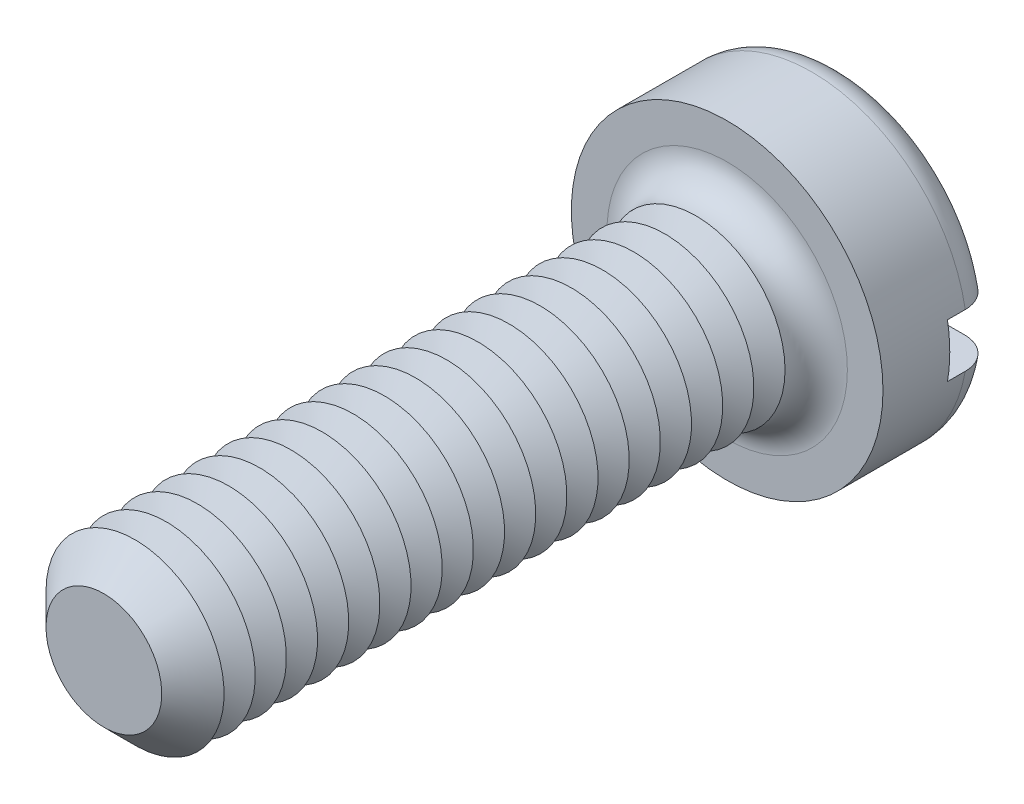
ISO-10303-21;
HEADER;
FILE_DESCRIPTION(('STEP AP214'),'2;1');
FILE_NAME('part.step','',(''),(''),'','','');
FILE_SCHEMA(('AUTOMOTIVE_DESIGN { 1 0 10303 214 1 1 1 1 }'));
ENDSEC;
DATA;
#1=APPLICATION_CONTEXT('core data for automotive mechanical design processes');
#2=APPLICATION_PROTOCOL_DEFINITION('international standard','automotive_design',2000,#1);
#3=PRODUCT_CONTEXT('',#1,'mechanical');
#4=PRODUCT('Part','Part','',(#3));
#5=PRODUCT_RELATED_PRODUCT_CATEGORY('part','',(#4));
#6=PRODUCT_DEFINITION_FORMATION('','',#4);
#7=PRODUCT_DEFINITION_CONTEXT('part definition',#1,'design');
#8=PRODUCT_DEFINITION('design','',#6,#7);
#9=PRODUCT_DEFINITION_SHAPE('','',#8);
#10=(LENGTH_UNIT() NAMED_UNIT(*) SI_UNIT(.MILLI.,.METRE.));
#11=(NAMED_UNIT(*) PLANE_ANGLE_UNIT() SI_UNIT($,.RADIAN.));
#12=(NAMED_UNIT(*) SI_UNIT($,.STERADIAN.) SOLID_ANGLE_UNIT());
#13=UNCERTAINTY_MEASURE_WITH_UNIT(LENGTH_MEASURE(1.E-05),#10,'distance_accuracy_value','');
#14=(GEOMETRIC_REPRESENTATION_CONTEXT(3) GLOBAL_UNCERTAINTY_ASSIGNED_CONTEXT((#13)) GLOBAL_UNIT_ASSIGNED_CONTEXT((#10,
#11,#12)) REPRESENTATION_CONTEXT('',''));
#15=CARTESIAN_POINT('',(0.,0.,0.));
#16=DIRECTION('',(0.,0.,1.));
#17=DIRECTION('',(1.,0.,0.));
#18=AXIS2_PLACEMENT_3D('',#15,#16,#17);
#19=CARTESIAN_POINT('',(0.,0.,-2.6));
#20=DIRECTION('',(0.,0.,1.));
#21=DIRECTION('',(1.,0.,0.));
#22=AXIS2_PLACEMENT_3D('',#19,#20,#21);
#23=PLANE('',#22);
#24=CARTESIAN_POINT('',(0.,0.,-2.6));
#25=DIRECTION('',(0.,0.,1.));
#26=DIRECTION('',(1.,0.,0.));
#27=AXIS2_PLACEMENT_3D('',#24,#25,#26);
#28=CIRCLE('',#27,2.8);
#29=CARTESIAN_POINT('',(-2.73495886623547,0.6,-2.6));
#30=VERTEX_POINT('',#29);
#31=CARTESIAN_POINT('',(2.73495886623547,0.6,-2.6));
#32=VERTEX_POINT('',#31);
#33=EDGE_CURVE('E116',#30,#32,#28,.F.);
#34=ORIENTED_EDGE('',*,*,#33,.T.);
#35=DIRECTION('',(1.,0.,0.));
#36=VECTOR('',#35,1.);
#37=CARTESIAN_POINT('',(-3.5,0.600000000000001,-2.6));
#38=LINE('',#37,#36);
#39=EDGE_CURVE('E111',#30,#32,#38,.T.);
#40=ORIENTED_EDGE('',*,*,#39,.F.);
#41=EDGE_LOOP('',(#34,#40));
#42=FACE_BOUND('',#41,.T.);
#43=ADVANCED_FACE('F39',(#42),#23,.F.);
#44=CARTESIAN_POINT('',(0.,0.,-1.9));
#45=DIRECTION('',(0.,0.,1.));
#46=DIRECTION('',(1.,0.,0.));
#47=AXIS2_PLACEMENT_3D('',#44,#45,#46);
#48=TOROIDAL_SURFACE('',#47,2.8,0.7);
#49=CARTESIAN_POINT('',(-3.24550494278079,0.600000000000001,-2.38938679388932));
#50=CARTESIAN_POINT('',(-3.21724139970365,0.600000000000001,-2.41780774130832));
#51=CARTESIAN_POINT('',(-3.18652103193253,0.600000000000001,-2.44383169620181));
#52=CARTESIAN_POINT('',(-3.12110229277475,0.600000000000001,-2.49034599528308));
#53=CARTESIAN_POINT('',(-3.08639834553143,0.6,-2.51082844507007));
#54=CARTESIAN_POINT('',(-3.01410013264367,0.6,-2.54568075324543));
#55=CARTESIAN_POINT('',(-2.97650963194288,0.6,-2.56005841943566));
#56=CARTESIAN_POINT('',(-2.89948250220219,0.6,-2.58239238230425));
#57=CARTESIAN_POINT('',(-2.86004633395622,0.6,-2.59035027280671));
#58=CARTESIAN_POINT('',(-2.77983715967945,0.6,-2.5997577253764));
#59=CARTESIAN_POINT('',(-2.73905311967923,0.6,-2.60111317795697));
#60=CARTESIAN_POINT('',(-2.65781876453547,0.6,-2.59706866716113));
#61=CARTESIAN_POINT('',(-2.61736849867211,0.6,-2.59166772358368));
#62=CARTESIAN_POINT('',(-2.53729983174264,0.6,-2.57414594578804));
#63=CARTESIAN_POINT('',(-2.49770360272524,0.6,-2.56192363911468));
#64=CARTESIAN_POINT('',(-2.421111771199,0.6,-2.5310238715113));
#65=CARTESIAN_POINT('',(-2.38411632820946,0.6,-2.51234601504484));
#66=CARTESIAN_POINT('',(-2.31371213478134,0.6,-2.46896762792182));
#67=CARTESIAN_POINT('',(-2.28031240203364,0.6,-2.44425244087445));
#68=CARTESIAN_POINT('',(-2.21823311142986,0.6,-2.38946667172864));
#69=CARTESIAN_POINT('',(-2.18955321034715,0.6,-2.35939647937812));
#70=CARTESIAN_POINT('',(-2.13836074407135,0.6,-2.29532787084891));
#71=CARTESIAN_POINT('',(-2.11574147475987,0.6,-2.26141482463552));
#72=CARTESIAN_POINT('',(-2.07677080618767,0.6,-2.19015935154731));
#73=CARTESIAN_POINT('',(-2.06041784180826,0.6,-2.15281778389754));
#74=CARTESIAN_POINT('',(-2.03508596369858,0.6,-2.07723332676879));
#75=CARTESIAN_POINT('',(-2.02585871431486,0.6,-2.03907365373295));
#76=CARTESIAN_POINT('',(-2.01416722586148,0.6,-1.96173417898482));
#77=CARTESIAN_POINT('',(-2.01170151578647,0.6,-1.92255460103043));
#78=CARTESIAN_POINT('',(-2.01359934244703,0.6,-1.84555709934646));
#79=CARTESIAN_POINT('',(-2.01775787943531,0.6,-1.80773393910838));
#80=CARTESIAN_POINT('',(-2.03236373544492,0.6,-1.73332511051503));
#81=CARTESIAN_POINT('',(-2.04281097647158,0.6,-1.69673942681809));
#82=CARTESIAN_POINT('',(-2.06962963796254,0.6,-1.62577336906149));
#83=CARTESIAN_POINT('',(-2.08600685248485,0.6,-1.59139519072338));
#84=CARTESIAN_POINT('',(-2.12413495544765,0.6,-1.52576356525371));
#85=CARTESIAN_POINT('',(-2.14588657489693,0.6,-1.49451054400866));
#86=CARTESIAN_POINT('',(-2.19483541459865,0.6,-1.43498643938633));
#87=CARTESIAN_POINT('',(-2.22217844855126,0.6,-1.40683532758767));
#88=CARTESIAN_POINT('',(-2.28105616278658,0.6,-1.35532544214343));
#89=CARTESIAN_POINT('',(-2.3125916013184,0.6,-1.33196753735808));
#90=CARTESIAN_POINT('',(-2.38018779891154,0.6,-1.28984356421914));
#91=CARTESIAN_POINT('',(-2.41637068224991,0.6,-1.27127330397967));
#92=CARTESIAN_POINT('',(-2.49129688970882,0.6,-1.24032971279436));
#93=CARTESIAN_POINT('',(-2.53004053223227,0.6,-1.22795715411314));
#94=CARTESIAN_POINT('',(-2.6098393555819,0.6,-1.2095515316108));
#95=CARTESIAN_POINT('',(-2.65092550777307,0.6,-1.20365237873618));
#96=CARTESIAN_POINT('',(-2.7335069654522,0.6,-1.1988380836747));
#97=CARTESIAN_POINT('',(-2.7750022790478,0.6,-1.19992308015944));
#98=CARTESIAN_POINT('',(-2.85718851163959,0.6,-1.20909046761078));
#99=CARTESIAN_POINT('',(-2.8978799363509,0.6,-1.21716830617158));
#100=CARTESIAN_POINT('',(-2.97729176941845,0.6,-1.24014327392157));
#101=CARTESIAN_POINT('',(-3.01601231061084,0.6,-1.25503994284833));
#102=CARTESIAN_POINT('',(-3.08976822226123,0.6,-1.29101066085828));
#103=CARTESIAN_POINT('',(-3.12484927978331,0.600000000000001,-1.31199098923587));
#104=CARTESIAN_POINT('',(-3.19090022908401,0.600000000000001,-1.35965144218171));
#105=CARTESIAN_POINT('',(-3.22187053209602,0.600000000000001,-1.38633099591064));
#106=CARTESIAN_POINT('',(-3.2781946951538,0.600000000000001,-1.44408564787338));
#107=CARTESIAN_POINT('',(-3.3036441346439,0.600000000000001,-1.47506754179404));
#108=CARTESIAN_POINT('',(-3.34887649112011,0.600000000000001,-1.54092398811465));
#109=CARTESIAN_POINT('',(-3.36865993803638,0.600000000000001,-1.57579817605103));
#110=CARTESIAN_POINT('',(-3.40166738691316,0.600000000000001,-1.64783067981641));
#111=CARTESIAN_POINT('',(-3.41499360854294,0.600000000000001,-1.68494217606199));
#112=CARTESIAN_POINT('',(-3.43515375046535,0.600000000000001,-1.76088675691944));
#113=CARTESIAN_POINT('',(-3.44198836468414,0.600000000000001,-1.79971965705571));
#114=CARTESIAN_POINT('',(-3.44891916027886,0.600000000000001,-1.87757893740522));
#115=CARTESIAN_POINT('',(-3.44908375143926,0.600000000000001,-1.91659924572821));
#116=CARTESIAN_POINT('',(-3.44284111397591,0.600000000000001,-1.99412088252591));
#117=CARTESIAN_POINT('',(-3.43643236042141,0.600000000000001,-2.03262208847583));
#118=CARTESIAN_POINT('',(-3.41725803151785,0.600000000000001,-2.10792315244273));
#119=CARTESIAN_POINT('',(-3.40450469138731,0.600000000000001,-2.14472613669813));
#120=CARTESIAN_POINT('',(-3.3730385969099,0.600000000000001,-2.21565060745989));
#121=CARTESIAN_POINT('',(-3.35433321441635,0.600000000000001,-2.24977534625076));
#122=CARTESIAN_POINT('',(-3.3201892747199,0.600000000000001,-2.30136364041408));
#123=CARTESIAN_POINT('',(-3.30647805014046,0.600000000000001,-2.31999402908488));
#124=CARTESIAN_POINT('',(-3.27728518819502,0.600000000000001,-2.35581090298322));
#125=CARTESIAN_POINT('',(-3.26180356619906,0.600000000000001,-2.37299740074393));
#126=CARTESIAN_POINT('',(-3.24550494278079,0.600000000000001,-2.38938679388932));
#127=B_SPLINE_CURVE_WITH_KNOTS('',3,(#49,#50,#51,#52,#53,#54,#55,#56,#57,#58,#59,#60,#61,#62,
#63,#64,#65,#66,#67,#68,#69,#70,#71,#72,#73,#74,#75,#76,#77,#78,#79,#80,#81,#82,#83,#84,#85,#86,
#87,#88,#89,#90,#91,#92,#93,#94,#95,#96,#97,#98,#99,#100,#101,#102,#103,#104,#105,#106,#107,
#108,#109,#110,#111,#112,#113,#114,#115,#116,#117,#118,#119,#120,#121,#122,#123,#124,#125,#126),
.UNSPECIFIED.,.T.,.F.,(4,2,2,2,2,2,2,2,2,2,2,2,2,2,2,2,2,2,2,2,2,2,2,2,2,2,2,2,2,2,2,2,2,2,2,2,
2,2,4),(0.,0.120160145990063,0.240490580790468,0.36066665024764,0.480812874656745,
0.602666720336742,0.724538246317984,0.848272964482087,0.972015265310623,1.09606100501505,
1.2200977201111,1.34178071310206,1.46343329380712,1.58062647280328,1.6977941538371,
1.81140573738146,1.92501591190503,2.03873739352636,2.15247435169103,2.26967910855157,
2.38690509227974,2.50835551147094,2.62982106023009,2.75375450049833,2.87769040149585,
3.00154567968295,3.12539259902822,3.24742469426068,3.36944457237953,3.48914477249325,
3.60883377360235,3.72656056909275,3.84427477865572,3.96078136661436,4.07731498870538,
4.19362474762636,4.3097910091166,4.37908387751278,4.44837614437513),.UNSPECIFIED.);
#128=CARTESIAN_POINT('',(-3.44818792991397,0.600000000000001,-1.8999999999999));
#129=VERTEX_POINT('',#128);
#130=EDGE_CURVE('E323',#129,#30,#127,.T.);
#131=ORIENTED_EDGE('',*,*,#130,.F.);
#132=CARTESIAN_POINT('',(0.,0.,-1.9));
#133=DIRECTION('',(0.,0.,1.));
#134=DIRECTION('',(1.,0.,0.));
#135=AXIS2_PLACEMENT_3D('',#132,#133,#134);
#136=CIRCLE('',#135,3.5);
#137=CARTESIAN_POINT('',(3.44818792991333,0.6,-1.9));
#138=VERTEX_POINT('',#137);
#139=EDGE_CURVE('E125',#138,#129,#136,.T.);
#140=ORIENTED_EDGE('',*,*,#139,.F.);
#141=CARTESIAN_POINT('',(2.1414268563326,0.6,-2.29762171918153));
#142=CARTESIAN_POINT('',(2.16505443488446,0.6,-2.33058245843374));
#143=CARTESIAN_POINT('',(2.19155609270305,0.6,-2.36152717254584));
#144=CARTESIAN_POINT('',(2.24942944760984,0.6,-2.41852964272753));
#145=CARTESIAN_POINT('',(2.28080921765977,0.6,-2.44457913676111));
#146=CARTESIAN_POINT('',(2.34741203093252,0.6,-2.49105381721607));
#147=CARTESIAN_POINT('',(2.38262862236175,0.6,-2.51148824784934));
#148=CARTESIAN_POINT('',(2.45593176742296,0.6,-2.54626881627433));
#149=CARTESIAN_POINT('',(2.49401741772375,0.6,-2.56061686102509));
#150=CARTESIAN_POINT('',(2.57272605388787,0.6,-2.58306429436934));
#151=CARTESIAN_POINT('',(2.6133821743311,0.6,-2.59104769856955));
#152=CARTESIAN_POINT('',(2.6954618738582,0.6,-2.60009608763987));
#153=CARTESIAN_POINT('',(2.73688552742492,0.6,-2.60116039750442));
#154=CARTESIAN_POINT('',(2.81941950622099,0.6,-2.5962925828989));
#155=CARTESIAN_POINT('',(2.86052888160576,0.6,-2.59034422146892));
#156=CARTESIAN_POINT('',(2.94113709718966,0.6,-2.57153687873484));
#157=CARTESIAN_POINT('',(2.98063603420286,0.6,-2.55867831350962));
#158=CARTESIAN_POINT('',(3.05633735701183,0.6,-2.52657771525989));
#159=CARTESIAN_POINT('',(3.09257627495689,0.6,-2.50742188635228));
#160=CARTESIAN_POINT('',(3.16123898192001,0.6,-2.46318606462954));
#161=CARTESIAN_POINT('',(3.19366316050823,0.6,-2.4381066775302));
#162=CARTESIAN_POINT('',(3.25312278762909,0.6,-2.38324481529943));
#163=CARTESIAN_POINT('',(3.28024842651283,0.6,-2.35356008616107));
#164=CARTESIAN_POINT('',(3.32902587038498,0.6,-2.28998971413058));
#165=CARTESIAN_POINT('',(3.35067820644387,0.6,-2.25610447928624));
#166=CARTESIAN_POINT('',(3.38751207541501,0.6,-2.18572286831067));
#167=CARTESIAN_POINT('',(3.40279804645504,0.6,-2.14928112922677));
#168=CARTESIAN_POINT('',(3.42695590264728,0.6,-2.07433042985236));
#169=CARTESIAN_POINT('',(3.43582824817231,0.6,-2.03582161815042));
#170=CARTESIAN_POINT('',(3.44682113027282,0.6,-1.95829536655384));
#171=CARTESIAN_POINT('',(3.44901648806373,0.6,-1.91928851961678));
#172=CARTESIAN_POINT('',(3.44680085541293,0.6,-1.84146366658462));
#173=CARTESIAN_POINT('',(3.44239008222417,0.6,-1.80264565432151));
#174=CARTESIAN_POINT('',(3.42712544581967,0.6,-1.72644634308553));
#175=CARTESIAN_POINT('',(3.41629508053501,0.6,-1.6890603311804));
#176=CARTESIAN_POINT('',(3.38853757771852,0.6,-1.61662604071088));
#177=CARTESIAN_POINT('',(3.37161039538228,0.6,-1.58157777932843));
#178=CARTESIAN_POINT('',(3.33207798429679,0.6,-1.51464178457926));
#179=CARTESIAN_POINT('',(3.30944854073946,0.6,-1.48276835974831));
#180=CARTESIAN_POINT('',(3.2592165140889,0.6,-1.42321861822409));
#181=CARTESIAN_POINT('',(3.23161370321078,0.6,-1.3955424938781));
#182=CARTESIAN_POINT('',(3.17188519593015,0.6,-1.34481834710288));
#183=CARTESIAN_POINT('',(3.13971065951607,0.6,-1.32182785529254));
#184=CARTESIAN_POINT('',(3.07201123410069,0.6,-1.28147003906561));
#185=CARTESIAN_POINT('',(3.03648608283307,0.6,-1.26410315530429));
#186=CARTESIAN_POINT('',(2.962449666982,0.6,-1.2351645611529));
#187=CARTESIAN_POINT('',(2.92389781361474,0.6,-1.22369671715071));
#188=CARTESIAN_POINT('',(2.84543273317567,0.6,-1.20726565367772));
#189=CARTESIAN_POINT('',(2.80551936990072,0.6,-1.20230308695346));
#190=CARTESIAN_POINT('',(2.72467191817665,0.6,-1.1989357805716));
#191=CARTESIAN_POINT('',(2.68373266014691,0.6,-1.20065484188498));
#192=CARTESIAN_POINT('',(2.60270222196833,0.6,-1.21084560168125));
#193=CARTESIAN_POINT('',(2.56261112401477,0.6,-1.21931795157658));
#194=CARTESIAN_POINT('',(2.48385954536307,0.6,-1.24292934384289));
#195=CARTESIAN_POINT('',(2.44522508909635,0.6,-1.25815531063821));
#196=CARTESIAN_POINT('',(2.37106165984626,0.6,-1.29488663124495));
#197=CARTESIAN_POINT('',(2.33553282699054,0.6,-1.31639226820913));
#198=CARTESIAN_POINT('',(2.2686996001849,0.6,-1.36507949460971));
#199=CARTESIAN_POINT('',(2.23738745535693,0.6,-1.39225042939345));
#200=CARTESIAN_POINT('',(2.17990424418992,0.6,-1.45157941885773));
#201=CARTESIAN_POINT('',(2.15373259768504,0.6,-1.48373691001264));
#202=CARTESIAN_POINT('',(2.10799355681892,0.6,-1.551327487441));
#203=CARTESIAN_POINT('',(2.08828258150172,0.6,-1.58666329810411));
#204=CARTESIAN_POINT('',(2.05534440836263,0.6,-1.66023600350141));
#205=CARTESIAN_POINT('',(2.042115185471,0.6,-1.6984719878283));
#206=CARTESIAN_POINT('',(2.02303126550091,0.6,-1.77519783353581));
#207=CARTESIAN_POINT('',(2.01691541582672,0.6,-1.8136228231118));
#208=CARTESIAN_POINT('',(2.01140375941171,0.6,-1.89096056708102));
#209=CARTESIAN_POINT('',(2.01200856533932,0.6,-1.92987336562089));
#210=CARTESIAN_POINT('',(2.01981617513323,0.6,-2.006065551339));
#211=CARTESIAN_POINT('',(2.02685835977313,0.6,-2.04336165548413));
#212=CARTESIAN_POINT('',(2.0470502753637,0.6,-2.1162250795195));
#213=CARTESIAN_POINT('',(2.06019252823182,0.6,-2.15179445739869));
#214=CARTESIAN_POINT('',(2.08525738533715,0.6,-2.20558874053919));
#215=CARTESIAN_POINT('',(2.09529161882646,0.6,-2.22471751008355));
#216=CARTESIAN_POINT('',(2.11708813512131,0.6,-2.26196179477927));
#217=CARTESIAN_POINT('',(2.12885034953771,0.6,-2.28007734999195));
#218=CARTESIAN_POINT('',(2.1414268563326,0.6,-2.29762171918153));
#219=B_SPLINE_CURVE_WITH_KNOTS('',3,(#141,#142,#143,#144,#145,#146,#147,#148,#149,#150,#151,
#152,#153,#154,#155,#156,#157,#158,#159,#160,#161,#162,#163,#164,#165,#166,#167,#168,#169,#170,
#171,#172,#173,#174,#175,#176,#177,#178,#179,#180,#181,#182,#183,#184,#185,#186,#187,#188,#189,
#190,#191,#192,#193,#194,#195,#196,#197,#198,#199,#200,#201,#202,#203,#204,#205,#206,#207,#208,
#209,#210,#211,#212,#213,#214,#215,#216,#217,#218),.UNSPECIFIED.,.T.,.F.,(4,2,2,2,2,2,2,2,2,2,2,
2,2,2,2,2,2,2,2,2,2,2,2,2,2,2,2,2,2,2,2,2,2,2,2,2,2,2,4),(0.,0.121582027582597,
0.243367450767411,0.364951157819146,0.486496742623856,0.610209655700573,0.733934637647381,
0.857946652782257,0.981951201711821,1.1043243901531,1.22668507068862,1.34673532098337,
1.46677391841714,1.58475736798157,1.70273234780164,1.81938035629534,1.93602452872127,
2.05224435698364,2.168465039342,2.28518782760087,2.40191596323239,2.52000081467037,
2.63809491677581,2.75820270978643,2.87832255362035,3.00067856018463,3.1230463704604,
3.24703703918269,3.37103329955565,3.49479843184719,3.6185495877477,3.73932715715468,
3.86006696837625,3.9762182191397,4.09238005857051,4.2057203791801,4.31892212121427,
4.38364046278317,4.44835624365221),.UNSPECIFIED.);
#220=EDGE_CURVE('E325',#32,#138,#219,.T.);
#221=ORIENTED_EDGE('',*,*,#220,.F.);
#222=ORIENTED_EDGE('',*,*,#33,.F.);
#223=EDGE_LOOP('',(#131,#140,#221,#222));
#224=FACE_BOUND('',#223,.T.);
#225=ADVANCED_FACE('F307',(#224),#48,.T.);
#226=CARTESIAN_POINT('',(0.,0.,-2.6));
#227=DIRECTION('',(0.,0.,1.));
#228=DIRECTION('',(1.,0.,0.));
#229=AXIS2_PLACEMENT_3D('',#226,#227,#228);
#230=CYLINDRICAL_SURFACE('',#229,3.5);
#231=DIRECTION('',(0.,0.,1.));
#232=VECTOR('',#231,1.);
#233=CARTESIAN_POINT('',(3.44818792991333,0.6,-2.6));
#234=LINE('',#233,#232);
#235=CARTESIAN_POINT('',(3.44818792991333,0.6,-1.5));
#236=VERTEX_POINT('',#235);
#237=EDGE_CURVE('E339',#138,#236,#234,.T.);
#238=ORIENTED_EDGE('',*,*,#237,.F.);
#239=ORIENTED_EDGE('',*,*,#139,.T.);
#240=DIRECTION('',(0.,0.,1.));
#241=VECTOR('',#240,1.);
#242=CARTESIAN_POINT('',(-3.44818792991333,0.600000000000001,-2.6));
#243=LINE('',#242,#241);
#244=CARTESIAN_POINT('',(-3.44818792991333,0.600000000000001,-1.5));
#245=VERTEX_POINT('',#244);
#246=EDGE_CURVE('E63',#245,#129,#243,.F.);
#247=ORIENTED_EDGE('',*,*,#246,.F.);
#248=CARTESIAN_POINT('',(0.,0.,-1.5));
#249=DIRECTION('',(0.,0.,-1.));
#250=DIRECTION('',(-1.,0.,0.));
#251=AXIS2_PLACEMENT_3D('',#248,#249,#250);
#252=CIRCLE('',#251,3.5);
#253=CARTESIAN_POINT('',(-3.44818792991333,-0.599999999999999,-1.5));
#254=VERTEX_POINT('',#253);
#255=EDGE_CURVE('E43',#245,#254,#252,.F.);
#256=ORIENTED_EDGE('',*,*,#255,.T.);
#257=DIRECTION('',(0.,0.,1.));
#258=VECTOR('',#257,1.);
#259=CARTESIAN_POINT('',(-3.44818792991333,-0.599999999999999,-2.6));
#260=LINE('',#259,#258);
#261=CARTESIAN_POINT('',(-3.44818792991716,-0.599999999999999,-1.90000000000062));
#262=VERTEX_POINT('',#261);
#263=EDGE_CURVE('E336',#262,#254,#260,.T.);
#264=ORIENTED_EDGE('',*,*,#263,.F.);
#265=CARTESIAN_POINT('',(3.44818792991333,-0.6,-1.9));
#266=VERTEX_POINT('',#265);
#267=EDGE_CURVE('E127',#262,#266,#136,.T.);
#268=ORIENTED_EDGE('',*,*,#267,.T.);
#269=DIRECTION('',(0.,0.,1.));
#270=VECTOR('',#269,1.);
#271=CARTESIAN_POINT('',(3.44818792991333,-0.6,-2.6));
#272=LINE('',#271,#270);
#273=CARTESIAN_POINT('',(3.44818792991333,-0.6,-1.5));
#274=VERTEX_POINT('',#273);
#275=EDGE_CURVE('E55',#274,#266,#272,.F.);
#276=ORIENTED_EDGE('',*,*,#275,.F.);
#277=EDGE_CURVE('E11',#274,#236,#252,.F.);
#278=ORIENTED_EDGE('',*,*,#277,.T.);
#279=EDGE_LOOP('',(#238,#239,#247,#256,#264,#268,#276,#278));
#280=FACE_BOUND('',#279,.T.);
#281=CARTESIAN_POINT('',(0.,0.,0.));
#282=DIRECTION('',(0.,0.,1.));
#283=DIRECTION('',(1.,0.,0.));
#284=AXIS2_PLACEMENT_3D('',#281,#282,#283);
#285=CIRCLE('',#284,3.5);
#286=CARTESIAN_POINT('',(3.5,0.,0.));
#287=VERTEX_POINT('',#286);
#288=EDGE_CURVE('E342',#287,#287,#285,.T.);
#289=ORIENTED_EDGE('',*,*,#288,.F.);
#290=EDGE_LOOP('',(#289));
#291=FACE_BOUND('',#290,.T.);
#292=ADVANCED_FACE('F303',(#280,#291),#230,.T.);
#293=CARTESIAN_POINT('',(2.73495886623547,-0.6,-2.6));
#294=VERTEX_POINT('',#293);
#295=CARTESIAN_POINT('',(-2.73495886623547,-0.6,-2.6));
#296=VERTEX_POINT('',#295);
#297=EDGE_CURVE('E109',#294,#296,#28,.F.);
#298=ORIENTED_EDGE('',*,*,#297,.T.);
#299=DIRECTION('',(-1.,0.,0.));
#300=VECTOR('',#299,1.);
#301=CARTESIAN_POINT('',(-3.5,-0.599999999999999,-2.6));
#302=LINE('',#301,#300);
#303=EDGE_CURVE('E96',#294,#296,#302,.T.);
#304=ORIENTED_EDGE('',*,*,#303,.F.);
#305=EDGE_LOOP('',(#298,#304));
#306=FACE_BOUND('',#305,.T.);
#307=ADVANCED_FACE('F108',(#306),#23,.F.);
#308=CARTESIAN_POINT('',(0.,0.,0.));
#309=DIRECTION('',(0.,0.,1.));
#310=DIRECTION('',(1.,0.,0.));
#311=AXIS2_PLACEMENT_3D('',#308,#309,#310);
#312=PLANE('',#311);
#313=CARTESIAN_POINT('',(0.,0.,0.));
#314=DIRECTION('',(0.,0.,1.));
#315=DIRECTION('',(1.,0.,0.));
#316=AXIS2_PLACEMENT_3D('',#313,#314,#315);
#317=CIRCLE('',#316,2.7);
#318=CARTESIAN_POINT('',(2.7,0.,0.));
#319=VERTEX_POINT('',#318);
#320=EDGE_CURVE('E115',#319,#319,#317,.F.);
#321=ORIENTED_EDGE('',*,*,#320,.T.);
#322=EDGE_LOOP('',(#321));
#323=FACE_BOUND('',#322,.T.);
#324=ORIENTED_EDGE('',*,*,#288,.T.);
#325=EDGE_LOOP('',(#324));
#326=FACE_BOUND('',#325,.T.);
#327=ADVANCED_FACE('F302',(#323,#326),#312,.T.);
#328=CARTESIAN_POINT('',(-3.24550494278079,-0.599999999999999,-2.38938679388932));
#329=CARTESIAN_POINT('',(-3.27309693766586,-0.599999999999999,-2.36163611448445));
#330=CARTESIAN_POINT('',(-3.29838741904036,-0.599999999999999,-2.3315608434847));
#331=CARTESIAN_POINT('',(-3.34359429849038,-0.599999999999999,-2.26757659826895));
#332=CARTESIAN_POINT('',(-3.36350518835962,-0.599999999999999,-2.23366374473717));
#333=CARTESIAN_POINT('',(-3.39733065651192,-0.599999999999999,-2.16296274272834));
#334=CARTESIAN_POINT('',(-3.4112451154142,-0.599999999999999,-2.12617453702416));
#335=CARTESIAN_POINT('',(-3.43264462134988,-0.599999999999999,-2.05078178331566));
#336=CARTESIAN_POINT('',(-3.44013114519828,-0.599999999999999,-2.01217765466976));
#337=CARTESIAN_POINT('',(-3.44841975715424,-0.599999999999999,-1.9345391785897));
#338=CARTESIAN_POINT('',(-3.44926944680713,-0.599999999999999,-1.89550990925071));
#339=CARTESIAN_POINT('',(-3.44438358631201,-0.599999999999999,-1.81786552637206));
#340=CARTESIAN_POINT('',(-3.43864801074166,-0.599999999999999,-1.77925041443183));
#341=CARTESIAN_POINT('',(-3.42079221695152,-0.599999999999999,-1.70364264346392));
#342=CARTESIAN_POINT('',(-3.40869011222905,-0.599999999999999,-1.66664570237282));
#343=CARTESIAN_POINT('',(-3.37847692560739,-0.599999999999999,-1.59519424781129));
#344=CARTESIAN_POINT('',(-3.3603657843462,-0.599999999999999,-1.56073975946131));
#345=CARTESIAN_POINT('',(-3.31856549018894,-0.599999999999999,-1.4951524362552));
#346=CARTESIAN_POINT('',(-3.29484830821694,-0.599999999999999,-1.46403747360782));
#347=CARTESIAN_POINT('',(-3.24258489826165,-0.599999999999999,-1.40617131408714));
#348=CARTESIAN_POINT('',(-3.21403843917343,-0.599999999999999,-1.37942032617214));
#349=CARTESIAN_POINT('',(-3.15256084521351,-0.599999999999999,-1.33067963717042));
#350=CARTESIAN_POINT('',(-3.11958015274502,-0.599999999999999,-1.30875246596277));
#351=CARTESIAN_POINT('',(-3.0504559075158,-0.599999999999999,-1.27063718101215));
#352=CARTESIAN_POINT('',(-3.01431209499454,-0.6,-1.25444953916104));
#353=CARTESIAN_POINT('',(-2.93921710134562,-0.6,-1.22796796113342));
#354=CARTESIAN_POINT('',(-2.90022796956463,-0.6,-1.217781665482));
#355=CARTESIAN_POINT('',(-2.82110512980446,-0.6,-1.20396915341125));
#356=CARTESIAN_POINT('',(-2.7809713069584,-0.6,-1.2003435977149));
#357=CARTESIAN_POINT('',(-2.69990924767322,-0.6,-1.19969717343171));
#358=CARTESIAN_POINT('',(-2.65898001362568,-0.6,-1.20279937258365));
#359=CARTESIAN_POINT('',(-2.57819986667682,-0.6,-1.21574287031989));
#360=CARTESIAN_POINT('',(-2.53834905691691,-0.6,-1.22558481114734));
#361=CARTESIAN_POINT('',(-2.46035232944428,-0.6,-1.25189361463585));
#362=CARTESIAN_POINT('',(-2.42223314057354,-0.6,-1.2684398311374));
#363=CARTESIAN_POINT('',(-2.34932316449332,-0.6,-1.30771928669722));
#364=CARTESIAN_POINT('',(-2.31453248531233,-0.6,-1.33045272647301));
#365=CARTESIAN_POINT('',(-2.24945577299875,-0.6,-1.38141543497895));
#366=CARTESIAN_POINT('',(-2.21915255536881,-0.6,-1.40962272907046));
#367=CARTESIAN_POINT('',(-2.16386461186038,-0.6,-1.47084552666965));
#368=CARTESIAN_POINT('',(-2.13887916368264,-0.6,-1.50386037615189));
#369=CARTESIAN_POINT('',(-2.09568071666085,-0.6,-1.57285917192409));
#370=CARTESIAN_POINT('',(-2.07730739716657,-0.6,-1.60874263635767));
#371=CARTESIAN_POINT('',(-2.04712019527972,-0.6,-1.68316975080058));
#372=CARTESIAN_POINT('',(-2.03530452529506,-0.6,-1.72171267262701));
#373=CARTESIAN_POINT('',(-2.01901751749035,-0.6,-1.79878952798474));
#374=CARTESIAN_POINT('',(-2.01428434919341,-0.6,-1.8372682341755));
#375=CARTESIAN_POINT('',(-2.01150652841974,-0.6,-1.91446369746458));
#376=CARTESIAN_POINT('',(-2.01346084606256,-0.6,-1.95318041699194));
#377=CARTESIAN_POINT('',(-2.02386268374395,-0.6,-2.0288619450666));
#378=CARTESIAN_POINT('',(-2.03216724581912,-0.6,-2.06584654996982));
#379=CARTESIAN_POINT('',(-2.05479337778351,-0.6,-2.13792373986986));
#380=CARTESIAN_POINT('',(-2.06911522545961,-0.6,-2.1730162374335));
#381=CARTESIAN_POINT('',(-2.10349906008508,-0.6,-2.24081034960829));
#382=CARTESIAN_POINT('',(-2.12363007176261,-0.6,-2.27347689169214));
#383=CARTESIAN_POINT('',(-2.16891308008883,-0.6,-2.33511902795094));
#384=CARTESIAN_POINT('',(-2.19406590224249,-0.6,-2.36409401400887));
#385=CARTESIAN_POINT('',(-2.24962389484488,-0.6,-2.41861972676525));
#386=CARTESIAN_POINT('',(-2.28018314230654,-0.6,-2.44401345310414));
#387=CARTESIAN_POINT('',(-2.34501720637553,-0.6,-2.48950558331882));
#388=CARTESIAN_POINT('',(-2.37929266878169,-0.6,-2.50960306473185));
#389=CARTESIAN_POINT('',(-2.45179417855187,-0.6,-2.54458276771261));
#390=CARTESIAN_POINT('',(-2.49011248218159,-0.6,-2.55927401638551));
#391=CARTESIAN_POINT('',(-2.56865227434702,-0.6,-2.58211133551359));
#392=CARTESIAN_POINT('',(-2.60887386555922,-0.6,-2.59025705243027));
#393=CARTESIAN_POINT('',(-2.69064746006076,-0.6,-2.59982905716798));
#394=CARTESIAN_POINT('',(-2.73220999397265,-0.6,-2.60116580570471));
#395=CARTESIAN_POINT('',(-2.81497658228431,-0.6,-2.59679700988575));
#396=CARTESIAN_POINT('',(-2.85618055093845,-0.6,-2.59108982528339));
#397=CARTESIAN_POINT('',(-2.93677683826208,-0.6,-2.57279487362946));
#398=CARTESIAN_POINT('',(-2.97617834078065,-0.6,-2.56024753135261));
#399=CARTESIAN_POINT('',(-3.05222242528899,-0.6,-2.52860709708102));
#400=CARTESIAN_POINT('',(-3.08886850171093,-0.599999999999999,-2.50952247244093));
#401=CARTESIAN_POINT('',(-3.14562501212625,-0.599999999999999,-2.47340693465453));
#402=CARTESIAN_POINT('',(-3.16689358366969,-0.599999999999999,-2.45816337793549));
#403=CARTESIAN_POINT('',(-3.20761866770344,-0.599999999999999,-2.42542115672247));
#404=CARTESIAN_POINT('',(-3.22707520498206,-0.599999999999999,-2.40792252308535));
#405=CARTESIAN_POINT('',(-3.24550494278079,-0.599999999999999,-2.38938679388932));
#406=B_SPLINE_CURVE_WITH_KNOTS('',3,(#328,#329,#330,#331,#332,#333,#334,#335,#336,#337,#338,
#339,#340,#341,#342,#343,#344,#345,#346,#347,#348,#349,#350,#351,#352,#353,#354,#355,#356,#357,
#358,#359,#360,#361,#362,#363,#364,#365,#366,#367,#368,#369,#370,#371,#372,#373,#374,#375,#376,
#377,#378,#379,#380,#381,#382,#383,#384,#385,#386,#387,#388,#389,#390,#391,#392,#393,#394,#395,
#396,#397,#398,#399,#400,#401,#402,#403,#404,#405),.UNSPECIFIED.,.T.,.F.,(4,2,2,2,2,2,2,2,2,2,2,
2,2,2,2,2,2,2,2,2,2,2,2,2,2,2,2,2,2,2,2,2,2,2,2,2,2,2,4),(0.,0.117306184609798,
0.234732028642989,0.352160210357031,0.469561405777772,0.586119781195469,0.702678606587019,
0.818907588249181,0.935137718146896,1.05196174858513,1.1687913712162,1.2870562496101,
1.40533084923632,1.52566688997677,1.64601504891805,1.76858322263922,1.89116307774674,
2.01523830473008,2.13931755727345,2.26290863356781,2.38648291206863,2.50681878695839,
2.62712184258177,2.74285697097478,2.85857427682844,2.97176054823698,3.08495204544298,
3.19954814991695,3.31416310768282,3.43282436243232,3.55150627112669,3.67404987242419,
3.79660009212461,3.92075778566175,4.04494439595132,4.16840490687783,4.29170610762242,
4.3700604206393,4.44841366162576),.UNSPECIFIED.);
#407=EDGE_CURVE('E103',#296,#262,#406,.T.);
#408=ORIENTED_EDGE('',*,*,#407,.F.);
#409=ORIENTED_EDGE('',*,*,#297,.F.);
#410=CARTESIAN_POINT('',(2.1414268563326,-0.6,-2.29762171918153));
#411=CARTESIAN_POINT('',(2.11900044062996,-0.6,-2.26633119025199));
#412=CARTESIAN_POINT('',(2.09913154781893,-0.6,-2.23318080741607));
#413=CARTESIAN_POINT('',(2.06517900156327,-0.6,-2.16401111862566));
#414=CARTESIAN_POINT('',(2.05109968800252,-0.6,-2.12798968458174));
#415=CARTESIAN_POINT('',(2.02923593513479,-0.6,-2.05404277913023));
#416=CARTESIAN_POINT('',(2.02145692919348,-0.6,-2.01611569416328));
#417=CARTESIAN_POINT('',(2.01251710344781,-0.6,-1.93949649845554));
#418=CARTESIAN_POINT('',(2.01135461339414,-0.6,-1.90080458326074));
#419=CARTESIAN_POINT('',(2.01564803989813,-0.6,-1.82450508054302));
#420=CARTESIAN_POINT('',(2.02098305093,-0.6,-1.78689061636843));
#421=CARTESIAN_POINT('',(2.03786826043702,-0.6,-1.71308589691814));
#422=CARTESIAN_POINT('',(2.04941870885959,-0.6,-1.67689569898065));
#423=CARTESIAN_POINT('',(2.07838664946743,-0.6,-1.60676639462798));
#424=CARTESIAN_POINT('',(2.09582944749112,-0.6,-1.57283776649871));
#425=CARTESIAN_POINT('',(2.1359925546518,-0.6,-1.50826612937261));
#426=CARTESIAN_POINT('',(2.15871360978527,-0.6,-1.47762358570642));
#427=CARTESIAN_POINT('',(2.20955413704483,-0.6,-1.41943384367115));
#428=CARTESIAN_POINT('',(2.23782364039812,-0.6,-1.39201777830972));
#429=CARTESIAN_POINT('',(2.29842612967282,-0.6,-1.34212199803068));
#430=CARTESIAN_POINT('',(2.33075984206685,-0.6,-1.31964316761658));
#431=CARTESIAN_POINT('',(2.399806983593,-0.6,-1.27945238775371));
#432=CARTESIAN_POINT('',(2.43663466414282,-0.6,-1.26193653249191));
#433=CARTESIAN_POINT('',(2.51267241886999,-0.6,-1.23320660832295));
#434=CARTESIAN_POINT('',(2.55188277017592,-0.6,-1.22199327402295));
#435=CARTESIAN_POINT('',(2.63235000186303,-0.6,-1.20602688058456));
#436=CARTESIAN_POINT('',(2.673631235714,-0.6,-1.20139617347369));
#437=CARTESIAN_POINT('',(2.7563863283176,-0.6,-1.19914622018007));
#438=CARTESIAN_POINT('',(2.79786018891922,-0.6,-1.20152704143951));
#439=CARTESIAN_POINT('',(2.87971192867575,-0.6,-1.21326884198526));
#440=CARTESIAN_POINT('',(2.92009214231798,-0.6,-1.22261349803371));
#441=CARTESIAN_POINT('',(2.99866777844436,-0.6,-1.24805614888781));
#442=CARTESIAN_POINT('',(3.03686335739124,-0.6,-1.26415365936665));
#443=CARTESIAN_POINT('',(3.10934738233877,-0.6,-1.3023912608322));
#444=CARTESIAN_POINT('',(3.14368704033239,-0.6,-1.32443423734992));
#445=CARTESIAN_POINT('',(3.20808395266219,-0.6,-1.37407725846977));
#446=CARTESIAN_POINT('',(3.23814164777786,-0.6,-1.40167673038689));
#447=CARTESIAN_POINT('',(3.29251534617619,-0.6,-1.46108303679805));
#448=CARTESIAN_POINT('',(3.3169296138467,-0.6,-1.49279994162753));
#449=CARTESIAN_POINT('',(3.35998418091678,-0.6,-1.55993706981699));
#450=CARTESIAN_POINT('',(3.37862502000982,-0.6,-1.59535694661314));
#451=CARTESIAN_POINT('',(3.40930212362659,-0.6,-1.668283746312));
#452=CARTESIAN_POINT('',(3.42143897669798,-0.6,-1.70574837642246));
#453=CARTESIAN_POINT('',(3.43918305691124,-0.6,-1.78219297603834));
#454=CARTESIAN_POINT('',(3.44479069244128,-0.6,-1.82117285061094));
#455=CARTESIAN_POINT('',(3.44928173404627,-0.6,-1.89914596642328));
#456=CARTESIAN_POINT('',(3.44822835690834,-0.6,-1.93813558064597));
#457=CARTESIAN_POINT('',(3.43957811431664,-0.6,-2.0153811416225));
#458=CARTESIAN_POINT('',(3.43198139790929,-0.6,-2.05363710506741));
#459=CARTESIAN_POINT('',(3.41049386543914,-0.6,-2.12826741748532));
#460=CARTESIAN_POINT('',(3.39661362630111,-0.6,-2.16464481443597));
#461=CARTESIAN_POINT('',(3.36297924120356,-0.6,-2.23457274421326));
#462=CARTESIAN_POINT('',(3.34322499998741,-0.6,-2.26812323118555));
#463=CARTESIAN_POINT('',(3.29828706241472,-0.6,-2.33167864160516));
#464=CARTESIAN_POINT('',(3.27307040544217,-0.6,-2.36166024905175));
#465=CARTESIAN_POINT('',(3.21802069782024,-0.6,-2.41703165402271));
#466=CARTESIAN_POINT('',(3.18818738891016,-0.6,-2.44242119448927));
#467=CARTESIAN_POINT('',(3.12433871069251,-0.6,-2.48825551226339));
#468=CARTESIAN_POINT('',(3.09027338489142,-0.6,-2.50863067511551));
#469=CARTESIAN_POINT('',(3.01925175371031,-0.6,-2.54348754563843));
#470=CARTESIAN_POINT('',(2.982295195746,-0.6,-2.55796873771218));
#471=CARTESIAN_POINT('',(2.90583499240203,-0.6,-2.58090526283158));
#472=CARTESIAN_POINT('',(2.86629758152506,-0.6,-2.58924801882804));
#473=CARTESIAN_POINT('',(2.78639041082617,-0.6,-2.59930573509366));
#474=CARTESIAN_POINT('',(2.7460205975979,-0.6,-2.60102026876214));
#475=CARTESIAN_POINT('',(2.66482039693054,-0.6,-2.59779078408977));
#476=CARTESIAN_POINT('',(2.62399477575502,-0.6,-2.59272651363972));
#477=CARTESIAN_POINT('',(2.54373809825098,-0.6,-2.57588976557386));
#478=CARTESIAN_POINT('',(2.50430750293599,-0.6,-2.56411509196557));
#479=CARTESIAN_POINT('',(2.42753167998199,-0.6,-2.53401488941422));
#480=CARTESIAN_POINT('',(2.39021407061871,-0.6,-2.51561892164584));
#481=CARTESIAN_POINT('',(2.31925431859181,-0.6,-2.4727929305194));
#482=CARTESIAN_POINT('',(2.28560806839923,-0.6,-2.44836975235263));
#483=CARTESIAN_POINT('',(2.23316677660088,-0.6,-2.40295212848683));
#484=CARTESIAN_POINT('',(2.21309339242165,-0.6,-2.38341311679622));
#485=CARTESIAN_POINT('',(2.17537212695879,-0.6,-2.34211733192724));
#486=CARTESIAN_POINT('',(2.1577241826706,-0.6,-2.32036061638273));
#487=CARTESIAN_POINT('',(2.1414268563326,-0.6,-2.29762171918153));
#488=B_SPLINE_CURVE_WITH_KNOTS('',3,(#410,#411,#412,#413,#414,#415,#416,#417,#418,#419,#420,
#421,#422,#423,#424,#425,#426,#427,#428,#429,#430,#431,#432,#433,#434,#435,#436,#437,#438,#439,
#440,#441,#442,#443,#444,#445,#446,#447,#448,#449,#450,#451,#452,#453,#454,#455,#456,#457,#458,
#459,#460,#461,#462,#463,#464,#465,#466,#467,#468,#469,#470,#471,#472,#473,#474,#475,#476,#477,
#478,#479,#480,#481,#482,#483,#484,#485,#486,#487),.UNSPECIFIED.,.T.,.F.,(4,2,2,2,2,2,2,2,2,2,2,
2,2,2,2,2,2,2,2,2,2,2,2,2,2,2,2,2,2,2,2,2,2,2,2,2,2,2,4),(0.,0.115394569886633,
0.230875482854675,0.346455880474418,0.462007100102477,0.575440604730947,0.688878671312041,
0.802810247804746,0.91675793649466,1.03436780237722,1.15199872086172,1.27377854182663,
1.39557255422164,1.51960202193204,1.64363268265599,1.76737352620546,1.89110549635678,
2.01292743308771,2.13473682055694,2.25423121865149,2.37371444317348,2.49129215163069,
2.60886250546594,2.72531873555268,2.8417723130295,2.95803059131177,3.07429075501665,
3.19127301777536,3.30826182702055,3.42679321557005,3.54533497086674,3.66599996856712,
3.78667273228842,3.90951478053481,4.03239705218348,4.15662720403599,4.28071691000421,
4.36457658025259,4.44843407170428),.UNSPECIFIED.);
#489=EDGE_CURVE('E92',#266,#294,#488,.T.);
#490=ORIENTED_EDGE('',*,*,#489,.F.);
#491=ORIENTED_EDGE('',*,*,#267,.F.);
#492=EDGE_LOOP('',(#408,#409,#490,#491));
#493=FACE_BOUND('',#492,.T.);
#494=ADVANCED_FACE('F113',(#493),#48,.T.);
#495=CARTESIAN_POINT('',(0.,0.,0.699999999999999));
#496=DIRECTION('',(0.,0.,1.));
#497=DIRECTION('',(1.,0.,0.));
#498=AXIS2_PLACEMENT_3D('',#495,#496,#497);
#499=TOROIDAL_SURFACE('',#498,2.7,0.7);
#500=ORIENTED_EDGE('',*,*,#320,.F.);
#501=EDGE_LOOP('',(#500));
#502=FACE_BOUND('',#501,.T.);
#503=CARTESIAN_POINT('',(0.,0.,0.699999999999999));
#504=DIRECTION('',(0.,0.,-1.));
#505=DIRECTION('',(-1.,0.,0.));
#506=AXIS2_PLACEMENT_3D('',#503,#504,#505);
#507=CIRCLE('',#506,2.);
#508=CARTESIAN_POINT('',(-2.,0.,0.699999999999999));
#509=VERTEX_POINT('',#508);
#510=EDGE_CURVE('E347',#509,#509,#507,.T.);
#511=ORIENTED_EDGE('',*,*,#510,.T.);
#512=EDGE_LOOP('',(#511));
#513=FACE_BOUND('',#512,.T.);
#514=ADVANCED_FACE('F295',(#502,#513),#499,.F.);
#515=CARTESIAN_POINT('',(0.,0.,1.05));
#516=DIRECTION('',(0.,0.,-1.));
#517=DIRECTION('',(-1.,0.,0.));
#518=AXIS2_PLACEMENT_3D('',#515,#516,#517);
#519=CONICAL_SURFACE('',#518,1.39378221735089,1.0471975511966);
#520=ORIENTED_EDGE('',*,*,#510,.F.);
#521=EDGE_LOOP('',(#520));
#522=FACE_BOUND('',#521,.T.);
#523=CARTESIAN_POINT('',(0.,0.,1.05));
#524=DIRECTION('',(0.,0.,-1.));
#525=DIRECTION('',(-1.,0.,0.));
#526=AXIS2_PLACEMENT_3D('',#523,#524,#525);
#527=CIRCLE('',#526,1.39378221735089);
#528=CARTESIAN_POINT('',(-1.39378221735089,0.,1.05));
#529=VERTEX_POINT('',#528);
#530=EDGE_CURVE('E353',#529,#529,#527,.T.);
#531=ORIENTED_EDGE('',*,*,#530,.T.);
#532=EDGE_LOOP('',(#531));
#533=FACE_BOUND('',#532,.T.);
#534=ADVANCED_FACE('F291',(#522,#533),#519,.T.);
#535=CARTESIAN_POINT('',(0.,0.,1.4));
#536=DIRECTION('',(0.,0.,1.));
#537=DIRECTION('',(1.,0.,0.));
#538=AXIS2_PLACEMENT_3D('',#535,#536,#537);
#539=CONICAL_SURFACE('',#538,2.,1.0471975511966);
#540=ORIENTED_EDGE('',*,*,#530,.F.);
#541=EDGE_LOOP('',(#540));
#542=FACE_BOUND('',#541,.T.);
#543=CARTESIAN_POINT('',(0.,0.,1.4));
#544=DIRECTION('',(0.,0.,-1.));
#545=DIRECTION('',(-1.,0.,0.));
#546=AXIS2_PLACEMENT_3D('',#543,#544,#545);
#547=CIRCLE('',#546,2.);
#548=CARTESIAN_POINT('',(-2.,0.,1.4));
#549=VERTEX_POINT('',#548);
#550=EDGE_CURVE('E359',#549,#549,#547,.T.);
#551=ORIENTED_EDGE('',*,*,#550,.T.);
#552=EDGE_LOOP('',(#551));
#553=FACE_BOUND('',#552,.T.);
#554=ADVANCED_FACE('F287',(#542,#553),#539,.T.);
#555=CARTESIAN_POINT('',(0.,0.,1.75));
#556=DIRECTION('',(0.,0.,-1.));
#557=DIRECTION('',(-1.,0.,0.));
#558=AXIS2_PLACEMENT_3D('',#555,#556,#557);
#559=CONICAL_SURFACE('',#558,1.39378221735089,1.0471975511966);
#560=ORIENTED_EDGE('',*,*,#550,.F.);
#561=EDGE_LOOP('',(#560));
#562=FACE_BOUND('',#561,.T.);
#563=CARTESIAN_POINT('',(0.,0.,1.75));
#564=DIRECTION('',(0.,0.,-1.));
#565=DIRECTION('',(-1.,0.,0.));
#566=AXIS2_PLACEMENT_3D('',#563,#564,#565);
#567=CIRCLE('',#566,1.39378221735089);
#568=CARTESIAN_POINT('',(-1.39378221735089,0.,1.75));
#569=VERTEX_POINT('',#568);
#570=EDGE_CURVE('E363',#569,#569,#567,.T.);
#571=ORIENTED_EDGE('',*,*,#570,.T.);
#572=EDGE_LOOP('',(#571));
#573=FACE_BOUND('',#572,.T.);
#574=ADVANCED_FACE('F283',(#562,#573),#559,.T.);
#575=CARTESIAN_POINT('',(0.,0.,2.1));
#576=DIRECTION('',(0.,0.,1.));
#577=DIRECTION('',(1.,0.,0.));
#578=AXIS2_PLACEMENT_3D('',#575,#576,#577);
#579=CONICAL_SURFACE('',#578,2.,1.0471975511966);
#580=ORIENTED_EDGE('',*,*,#570,.F.);
#581=EDGE_LOOP('',(#580));
#582=FACE_BOUND('',#581,.T.);
#583=CARTESIAN_POINT('',(0.,0.,2.1));
#584=DIRECTION('',(0.,0.,-1.));
#585=DIRECTION('',(-1.,0.,0.));
#586=AXIS2_PLACEMENT_3D('',#583,#584,#585);
#587=CIRCLE('',#586,2.);
#588=CARTESIAN_POINT('',(-2.,0.,2.1));
#589=VERTEX_POINT('',#588);
#590=EDGE_CURVE('E367',#589,#589,#587,.T.);
#591=ORIENTED_EDGE('',*,*,#590,.T.);
#592=EDGE_LOOP('',(#591));
#593=FACE_BOUND('',#592,.T.);
#594=ADVANCED_FACE('F279',(#582,#593),#579,.T.);
#595=CARTESIAN_POINT('',(0.,0.,2.45));
#596=DIRECTION('',(0.,0.,-1.));
#597=DIRECTION('',(-1.,0.,0.));
#598=AXIS2_PLACEMENT_3D('',#595,#596,#597);
#599=CONICAL_SURFACE('',#598,1.39378221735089,1.0471975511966);
#600=ORIENTED_EDGE('',*,*,#590,.F.);
#601=EDGE_LOOP('',(#600));
#602=FACE_BOUND('',#601,.T.);
#603=CARTESIAN_POINT('',(0.,0.,2.45));
#604=DIRECTION('',(0.,0.,-1.));
#605=DIRECTION('',(-1.,0.,0.));
#606=AXIS2_PLACEMENT_3D('',#603,#604,#605);
#607=CIRCLE('',#606,1.39378221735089);
#608=CARTESIAN_POINT('',(-1.39378221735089,0.,2.45));
#609=VERTEX_POINT('',#608);
#610=EDGE_CURVE('E371',#609,#609,#607,.T.);
#611=ORIENTED_EDGE('',*,*,#610,.T.);
#612=EDGE_LOOP('',(#611));
#613=FACE_BOUND('',#612,.T.);
#614=ADVANCED_FACE('F275',(#602,#613),#599,.T.);
#615=CARTESIAN_POINT('',(0.,0.,2.8));
#616=DIRECTION('',(0.,0.,1.));
#617=DIRECTION('',(1.,0.,0.));
#618=AXIS2_PLACEMENT_3D('',#615,#616,#617);
#619=CONICAL_SURFACE('',#618,2.,1.0471975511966);
#620=ORIENTED_EDGE('',*,*,#610,.F.);
#621=EDGE_LOOP('',(#620));
#622=FACE_BOUND('',#621,.T.);
#623=CARTESIAN_POINT('',(0.,0.,2.8));
#624=DIRECTION('',(0.,0.,-1.));
#625=DIRECTION('',(-1.,0.,0.));
#626=AXIS2_PLACEMENT_3D('',#623,#624,#625);
#627=CIRCLE('',#626,2.);
#628=CARTESIAN_POINT('',(-2.,0.,2.8));
#629=VERTEX_POINT('',#628);
#630=EDGE_CURVE('E375',#629,#629,#627,.T.);
#631=ORIENTED_EDGE('',*,*,#630,.T.);
#632=EDGE_LOOP('',(#631));
#633=FACE_BOUND('',#632,.T.);
#634=ADVANCED_FACE('F271',(#622,#633),#619,.T.);
#635=CARTESIAN_POINT('',(0.,0.,3.15));
#636=DIRECTION('',(0.,0.,-1.));
#637=DIRECTION('',(-1.,0.,0.));
#638=AXIS2_PLACEMENT_3D('',#635,#636,#637);
#639=CONICAL_SURFACE('',#638,1.39378221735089,1.0471975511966);
#640=ORIENTED_EDGE('',*,*,#630,.F.);
#641=EDGE_LOOP('',(#640));
#642=FACE_BOUND('',#641,.T.);
#643=CARTESIAN_POINT('',(0.,0.,3.15));
#644=DIRECTION('',(0.,0.,-1.));
#645=DIRECTION('',(-1.,0.,0.));
#646=AXIS2_PLACEMENT_3D('',#643,#644,#645);
#647=CIRCLE('',#646,1.39378221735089);
#648=CARTESIAN_POINT('',(-1.39378221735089,0.,3.15));
#649=VERTEX_POINT('',#648);
#650=EDGE_CURVE('E379',#649,#649,#647,.T.);
#651=ORIENTED_EDGE('',*,*,#650,.T.);
#652=EDGE_LOOP('',(#651));
#653=FACE_BOUND('',#652,.T.);
#654=ADVANCED_FACE('F267',(#642,#653),#639,.T.);
#655=CARTESIAN_POINT('',(0.,0.,3.5));
#656=DIRECTION('',(0.,0.,1.));
#657=DIRECTION('',(1.,0.,0.));
#658=AXIS2_PLACEMENT_3D('',#655,#656,#657);
#659=CONICAL_SURFACE('',#658,2.,1.0471975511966);
#660=ORIENTED_EDGE('',*,*,#650,.F.);
#661=EDGE_LOOP('',(#660));
#662=FACE_BOUND('',#661,.T.);
#663=CARTESIAN_POINT('',(0.,0.,3.5));
#664=DIRECTION('',(0.,0.,-1.));
#665=DIRECTION('',(-1.,0.,0.));
#666=AXIS2_PLACEMENT_3D('',#663,#664,#665);
#667=CIRCLE('',#666,2.);
#668=CARTESIAN_POINT('',(-2.,0.,3.5));
#669=VERTEX_POINT('',#668);
#670=EDGE_CURVE('E383',#669,#669,#667,.T.);
#671=ORIENTED_EDGE('',*,*,#670,.T.);
#672=EDGE_LOOP('',(#671));
#673=FACE_BOUND('',#672,.T.);
#674=ADVANCED_FACE('F263',(#662,#673),#659,.T.);
#675=CARTESIAN_POINT('',(0.,0.,3.85));
#676=DIRECTION('',(0.,0.,-1.));
#677=DIRECTION('',(-1.,0.,0.));
#678=AXIS2_PLACEMENT_3D('',#675,#676,#677);
#679=CONICAL_SURFACE('',#678,1.39378221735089,1.0471975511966);
#680=ORIENTED_EDGE('',*,*,#670,.F.);
#681=EDGE_LOOP('',(#680));
#682=FACE_BOUND('',#681,.T.);
#683=CARTESIAN_POINT('',(0.,0.,3.85));
#684=DIRECTION('',(0.,0.,-1.));
#685=DIRECTION('',(-1.,0.,0.));
#686=AXIS2_PLACEMENT_3D('',#683,#684,#685);
#687=CIRCLE('',#686,1.39378221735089);
#688=CARTESIAN_POINT('',(-1.39378221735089,0.,3.85));
#689=VERTEX_POINT('',#688);
#690=EDGE_CURVE('E387',#689,#689,#687,.T.);
#691=ORIENTED_EDGE('',*,*,#690,.T.);
#692=EDGE_LOOP('',(#691));
#693=FACE_BOUND('',#692,.T.);
#694=ADVANCED_FACE('F259',(#682,#693),#679,.T.);
#695=CARTESIAN_POINT('',(0.,0.,4.2));
#696=DIRECTION('',(0.,0.,1.));
#697=DIRECTION('',(1.,0.,0.));
#698=AXIS2_PLACEMENT_3D('',#695,#696,#697);
#699=CONICAL_SURFACE('',#698,2.,1.0471975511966);
#700=ORIENTED_EDGE('',*,*,#690,.F.);
#701=EDGE_LOOP('',(#700));
#702=FACE_BOUND('',#701,.T.);
#703=CARTESIAN_POINT('',(0.,0.,4.2));
#704=DIRECTION('',(0.,0.,-1.));
#705=DIRECTION('',(-1.,0.,0.));
#706=AXIS2_PLACEMENT_3D('',#703,#704,#705);
#707=CIRCLE('',#706,2.);
#708=CARTESIAN_POINT('',(-2.,0.,4.2));
#709=VERTEX_POINT('',#708);
#710=EDGE_CURVE('E391',#709,#709,#707,.T.);
#711=ORIENTED_EDGE('',*,*,#710,.T.);
#712=EDGE_LOOP('',(#711));
#713=FACE_BOUND('',#712,.T.);
#714=ADVANCED_FACE('F255',(#702,#713),#699,.T.);
#715=CARTESIAN_POINT('',(0.,0.,4.55));
#716=DIRECTION('',(0.,0.,-1.));
#717=DIRECTION('',(-1.,0.,0.));
#718=AXIS2_PLACEMENT_3D('',#715,#716,#717);
#719=CONICAL_SURFACE('',#718,1.39378221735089,1.0471975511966);
#720=ORIENTED_EDGE('',*,*,#710,.F.);
#721=EDGE_LOOP('',(#720));
#722=FACE_BOUND('',#721,.T.);
#723=CARTESIAN_POINT('',(0.,0.,4.55));
#724=DIRECTION('',(0.,0.,-1.));
#725=DIRECTION('',(-1.,0.,0.));
#726=AXIS2_PLACEMENT_3D('',#723,#724,#725);
#727=CIRCLE('',#726,1.39378221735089);
#728=CARTESIAN_POINT('',(-1.39378221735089,0.,4.55));
#729=VERTEX_POINT('',#728);
#730=EDGE_CURVE('E395',#729,#729,#727,.T.);
#731=ORIENTED_EDGE('',*,*,#730,.T.);
#732=EDGE_LOOP('',(#731));
#733=FACE_BOUND('',#732,.T.);
#734=ADVANCED_FACE('F251',(#722,#733),#719,.T.);
#735=CARTESIAN_POINT('',(0.,0.,4.9));
#736=DIRECTION('',(0.,0.,1.));
#737=DIRECTION('',(1.,0.,0.));
#738=AXIS2_PLACEMENT_3D('',#735,#736,#737);
#739=CONICAL_SURFACE('',#738,2.,1.0471975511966);
#740=ORIENTED_EDGE('',*,*,#730,.F.);
#741=EDGE_LOOP('',(#740));
#742=FACE_BOUND('',#741,.T.);
#743=CARTESIAN_POINT('',(0.,0.,4.9));
#744=DIRECTION('',(0.,0.,-1.));
#745=DIRECTION('',(-1.,0.,0.));
#746=AXIS2_PLACEMENT_3D('',#743,#744,#745);
#747=CIRCLE('',#746,2.);
#748=CARTESIAN_POINT('',(-2.,0.,4.9));
#749=VERTEX_POINT('',#748);
#750=EDGE_CURVE('E398',#749,#749,#747,.T.);
#751=ORIENTED_EDGE('',*,*,#750,.T.);
#752=EDGE_LOOP('',(#751));
#753=FACE_BOUND('',#752,.T.);
#754=ADVANCED_FACE('F247',(#742,#753),#739,.T.);
#755=CARTESIAN_POINT('',(0.,0.,5.25));
#756=DIRECTION('',(0.,0.,-1.));
#757=DIRECTION('',(-1.,0.,0.));
#758=AXIS2_PLACEMENT_3D('',#755,#756,#757);
#759=CONICAL_SURFACE('',#758,1.39378221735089,1.0471975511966);
#760=ORIENTED_EDGE('',*,*,#750,.F.);
#761=EDGE_LOOP('',(#760));
#762=FACE_BOUND('',#761,.T.);
#763=CARTESIAN_POINT('',(0.,0.,5.25));
#764=DIRECTION('',(0.,0.,-1.));
#765=DIRECTION('',(-1.,0.,0.));
#766=AXIS2_PLACEMENT_3D('',#763,#764,#765);
#767=CIRCLE('',#766,1.39378221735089);
#768=CARTESIAN_POINT('',(-1.39378221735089,0.,5.25));
#769=VERTEX_POINT('',#768);
#770=EDGE_CURVE('E402',#769,#769,#767,.T.);
#771=ORIENTED_EDGE('',*,*,#770,.T.);
#772=EDGE_LOOP('',(#771));
#773=FACE_BOUND('',#772,.T.);
#774=ADVANCED_FACE('F243',(#762,#773),#759,.T.);
#775=CARTESIAN_POINT('',(0.,0.,5.6));
#776=DIRECTION('',(0.,0.,1.));
#777=DIRECTION('',(1.,0.,0.));
#778=AXIS2_PLACEMENT_3D('',#775,#776,#777);
#779=CONICAL_SURFACE('',#778,2.,1.0471975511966);
#780=ORIENTED_EDGE('',*,*,#770,.F.);
#781=EDGE_LOOP('',(#780));
#782=FACE_BOUND('',#781,.T.);
#783=CARTESIAN_POINT('',(0.,0.,5.6));
#784=DIRECTION('',(0.,0.,-1.));
#785=DIRECTION('',(-1.,0.,0.));
#786=AXIS2_PLACEMENT_3D('',#783,#784,#785);
#787=CIRCLE('',#786,2.);
#788=CARTESIAN_POINT('',(-2.,0.,5.6));
#789=VERTEX_POINT('',#788);
#790=EDGE_CURVE('E406',#789,#789,#787,.T.);
#791=ORIENTED_EDGE('',*,*,#790,.T.);
#792=EDGE_LOOP('',(#791));
#793=FACE_BOUND('',#792,.T.);
#794=ADVANCED_FACE('F239',(#782,#793),#779,.T.);
#795=CARTESIAN_POINT('',(0.,0.,5.95));
#796=DIRECTION('',(0.,0.,-1.));
#797=DIRECTION('',(-1.,0.,0.));
#798=AXIS2_PLACEMENT_3D('',#795,#796,#797);
#799=CONICAL_SURFACE('',#798,1.39378221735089,1.0471975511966);
#800=ORIENTED_EDGE('',*,*,#790,.F.);
#801=EDGE_LOOP('',(#800));
#802=FACE_BOUND('',#801,.T.);
#803=CARTESIAN_POINT('',(0.,0.,5.95));
#804=DIRECTION('',(0.,0.,-1.));
#805=DIRECTION('',(-1.,0.,0.));
#806=AXIS2_PLACEMENT_3D('',#803,#804,#805);
#807=CIRCLE('',#806,1.39378221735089);
#808=CARTESIAN_POINT('',(-1.39378221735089,0.,5.95));
#809=VERTEX_POINT('',#808);
#810=EDGE_CURVE('E409',#809,#809,#807,.T.);
#811=ORIENTED_EDGE('',*,*,#810,.T.);
#812=EDGE_LOOP('',(#811));
#813=FACE_BOUND('',#812,.T.);
#814=ADVANCED_FACE('F235',(#802,#813),#799,.T.);
#815=CARTESIAN_POINT('',(0.,0.,6.3));
#816=DIRECTION('',(0.,0.,1.));
#817=DIRECTION('',(1.,0.,0.));
#818=AXIS2_PLACEMENT_3D('',#815,#816,#817);
#819=CONICAL_SURFACE('',#818,2.,1.0471975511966);
#820=ORIENTED_EDGE('',*,*,#810,.F.);
#821=EDGE_LOOP('',(#820));
#822=FACE_BOUND('',#821,.T.);
#823=CARTESIAN_POINT('',(0.,0.,6.3));
#824=DIRECTION('',(0.,0.,-1.));
#825=DIRECTION('',(-1.,0.,0.));
#826=AXIS2_PLACEMENT_3D('',#823,#824,#825);
#827=CIRCLE('',#826,2.);
#828=CARTESIAN_POINT('',(-2.,0.,6.3));
#829=VERTEX_POINT('',#828);
#830=EDGE_CURVE('E413',#829,#829,#827,.T.);
#831=ORIENTED_EDGE('',*,*,#830,.T.);
#832=EDGE_LOOP('',(#831));
#833=FACE_BOUND('',#832,.T.);
#834=ADVANCED_FACE('F231',(#822,#833),#819,.T.);
#835=CARTESIAN_POINT('',(0.,0.,6.65));
#836=DIRECTION('',(0.,0.,-1.));
#837=DIRECTION('',(-1.,0.,0.));
#838=AXIS2_PLACEMENT_3D('',#835,#836,#837);
#839=CONICAL_SURFACE('',#838,1.39378221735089,1.0471975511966);
#840=ORIENTED_EDGE('',*,*,#830,.F.);
#841=EDGE_LOOP('',(#840));
#842=FACE_BOUND('',#841,.T.);
#843=CARTESIAN_POINT('',(0.,0.,6.65));
#844=DIRECTION('',(0.,0.,-1.));
#845=DIRECTION('',(-1.,0.,0.));
#846=AXIS2_PLACEMENT_3D('',#843,#844,#845);
#847=CIRCLE('',#846,1.39378221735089);
#848=CARTESIAN_POINT('',(-1.39378221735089,0.,6.65));
#849=VERTEX_POINT('',#848);
#850=EDGE_CURVE('E417',#849,#849,#847,.T.);
#851=ORIENTED_EDGE('',*,*,#850,.T.);
#852=EDGE_LOOP('',(#851));
#853=FACE_BOUND('',#852,.T.);
#854=ADVANCED_FACE('F227',(#842,#853),#839,.T.);
#855=CARTESIAN_POINT('',(0.,0.,7.));
#856=DIRECTION('',(0.,0.,1.));
#857=DIRECTION('',(1.,0.,0.));
#858=AXIS2_PLACEMENT_3D('',#855,#856,#857);
#859=CONICAL_SURFACE('',#858,2.,1.0471975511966);
#860=ORIENTED_EDGE('',*,*,#850,.F.);
#861=EDGE_LOOP('',(#860));
#862=FACE_BOUND('',#861,.T.);
#863=CARTESIAN_POINT('',(0.,0.,7.));
#864=DIRECTION('',(0.,0.,-1.));
#865=DIRECTION('',(-1.,0.,0.));
#866=AXIS2_PLACEMENT_3D('',#863,#864,#865);
#867=CIRCLE('',#866,2.);
#868=CARTESIAN_POINT('',(-2.,0.,7.));
#869=VERTEX_POINT('',#868);
#870=EDGE_CURVE('E421',#869,#869,#867,.T.);
#871=ORIENTED_EDGE('',*,*,#870,.T.);
#872=EDGE_LOOP('',(#871));
#873=FACE_BOUND('',#872,.T.);
#874=ADVANCED_FACE('F223',(#862,#873),#859,.T.);
#875=CARTESIAN_POINT('',(0.,0.,7.35));
#876=DIRECTION('',(0.,0.,-1.));
#877=DIRECTION('',(-1.,0.,0.));
#878=AXIS2_PLACEMENT_3D('',#875,#876,#877);
#879=CONICAL_SURFACE('',#878,1.39378221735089,1.0471975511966);
#880=ORIENTED_EDGE('',*,*,#870,.F.);
#881=EDGE_LOOP('',(#880));
#882=FACE_BOUND('',#881,.T.);
#883=CARTESIAN_POINT('',(0.,0.,7.35));
#884=DIRECTION('',(0.,0.,-1.));
#885=DIRECTION('',(-1.,0.,0.));
#886=AXIS2_PLACEMENT_3D('',#883,#884,#885);
#887=CIRCLE('',#886,1.39378221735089);
#888=CARTESIAN_POINT('',(-1.39378221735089,0.,7.35));
#889=VERTEX_POINT('',#888);
#890=EDGE_CURVE('E425',#889,#889,#887,.T.);
#891=ORIENTED_EDGE('',*,*,#890,.T.);
#892=EDGE_LOOP('',(#891));
#893=FACE_BOUND('',#892,.T.);
#894=ADVANCED_FACE('F219',(#882,#893),#879,.T.);
#895=CARTESIAN_POINT('',(0.,0.,7.7));
#896=DIRECTION('',(0.,0.,1.));
#897=DIRECTION('',(1.,0.,0.));
#898=AXIS2_PLACEMENT_3D('',#895,#896,#897);
#899=CONICAL_SURFACE('',#898,2.,1.0471975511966);
#900=ORIENTED_EDGE('',*,*,#890,.F.);
#901=EDGE_LOOP('',(#900));
#902=FACE_BOUND('',#901,.T.);
#903=CARTESIAN_POINT('',(0.,0.,7.7));
#904=DIRECTION('',(0.,0.,-1.));
#905=DIRECTION('',(-1.,0.,0.));
#906=AXIS2_PLACEMENT_3D('',#903,#904,#905);
#907=CIRCLE('',#906,2.);
#908=CARTESIAN_POINT('',(-2.,0.,7.7));
#909=VERTEX_POINT('',#908);
#910=EDGE_CURVE('E429',#909,#909,#907,.T.);
#911=ORIENTED_EDGE('',*,*,#910,.T.);
#912=EDGE_LOOP('',(#911));
#913=FACE_BOUND('',#912,.T.);
#914=ADVANCED_FACE('F215',(#902,#913),#899,.T.);
#915=CARTESIAN_POINT('',(0.,0.,8.05));
#916=DIRECTION('',(0.,0.,-1.));
#917=DIRECTION('',(-1.,0.,0.));
#918=AXIS2_PLACEMENT_3D('',#915,#916,#917);
#919=CONICAL_SURFACE('',#918,1.39378221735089,1.0471975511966);
#920=ORIENTED_EDGE('',*,*,#910,.F.);
#921=EDGE_LOOP('',(#920));
#922=FACE_BOUND('',#921,.T.);
#923=CARTESIAN_POINT('',(0.,0.,8.05));
#924=DIRECTION('',(0.,0.,-1.));
#925=DIRECTION('',(-1.,0.,0.));
#926=AXIS2_PLACEMENT_3D('',#923,#924,#925);
#927=CIRCLE('',#926,1.39378221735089);
#928=CARTESIAN_POINT('',(-1.39378221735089,0.,8.05));
#929=VERTEX_POINT('',#928);
#930=EDGE_CURVE('E433',#929,#929,#927,.T.);
#931=ORIENTED_EDGE('',*,*,#930,.T.);
#932=EDGE_LOOP('',(#931));
#933=FACE_BOUND('',#932,.T.);
#934=ADVANCED_FACE('F211',(#922,#933),#919,.T.);
#935=CARTESIAN_POINT('',(0.,0.,8.4));
#936=DIRECTION('',(0.,0.,1.));
#937=DIRECTION('',(1.,0.,0.));
#938=AXIS2_PLACEMENT_3D('',#935,#936,#937);
#939=CONICAL_SURFACE('',#938,2.,1.0471975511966);
#940=ORIENTED_EDGE('',*,*,#930,.F.);
#941=EDGE_LOOP('',(#940));
#942=FACE_BOUND('',#941,.T.);
#943=CARTESIAN_POINT('',(0.,0.,8.4));
#944=DIRECTION('',(0.,0.,-1.));
#945=DIRECTION('',(-1.,0.,0.));
#946=AXIS2_PLACEMENT_3D('',#943,#944,#945);
#947=CIRCLE('',#946,2.);
#948=CARTESIAN_POINT('',(-2.,0.,8.4));
#949=VERTEX_POINT('',#948);
#950=EDGE_CURVE('E437',#949,#949,#947,.T.);
#951=ORIENTED_EDGE('',*,*,#950,.T.);
#952=EDGE_LOOP('',(#951));
#953=FACE_BOUND('',#952,.T.);
#954=ADVANCED_FACE('F207',(#942,#953),#939,.T.);
#955=CARTESIAN_POINT('',(0.,0.,8.75));
#956=DIRECTION('',(0.,0.,-1.));
#957=DIRECTION('',(-1.,0.,0.));
#958=AXIS2_PLACEMENT_3D('',#955,#956,#957);
#959=CONICAL_SURFACE('',#958,1.39378221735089,1.0471975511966);
#960=ORIENTED_EDGE('',*,*,#950,.F.);
#961=EDGE_LOOP('',(#960));
#962=FACE_BOUND('',#961,.T.);
#963=CARTESIAN_POINT('',(0.,0.,8.75));
#964=DIRECTION('',(0.,0.,-1.));
#965=DIRECTION('',(-1.,0.,0.));
#966=AXIS2_PLACEMENT_3D('',#963,#964,#965);
#967=CIRCLE('',#966,1.39378221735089);
#968=CARTESIAN_POINT('',(-1.39378221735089,0.,8.75));
#969=VERTEX_POINT('',#968);
#970=EDGE_CURVE('E440',#969,#969,#967,.T.);
#971=ORIENTED_EDGE('',*,*,#970,.T.);
#972=EDGE_LOOP('',(#971));
#973=FACE_BOUND('',#972,.T.);
#974=ADVANCED_FACE('F203',(#962,#973),#959,.T.);
#975=CARTESIAN_POINT('',(0.,0.,9.1));
#976=DIRECTION('',(0.,0.,1.));
#977=DIRECTION('',(1.,0.,0.));
#978=AXIS2_PLACEMENT_3D('',#975,#976,#977);
#979=CONICAL_SURFACE('',#978,2.,1.0471975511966);
#980=ORIENTED_EDGE('',*,*,#970,.F.);
#981=EDGE_LOOP('',(#980));
#982=FACE_BOUND('',#981,.T.);
#983=CARTESIAN_POINT('',(0.,0.,9.1));
#984=DIRECTION('',(0.,0.,-1.));
#985=DIRECTION('',(-1.,0.,0.));
#986=AXIS2_PLACEMENT_3D('',#983,#984,#985);
#987=CIRCLE('',#986,2.);
#988=CARTESIAN_POINT('',(-2.,0.,9.1));
#989=VERTEX_POINT('',#988);
#990=EDGE_CURVE('E444',#989,#989,#987,.T.);
#991=ORIENTED_EDGE('',*,*,#990,.T.);
#992=EDGE_LOOP('',(#991));
#993=FACE_BOUND('',#992,.T.);
#994=ADVANCED_FACE('F199',(#982,#993),#979,.T.);
#995=CARTESIAN_POINT('',(0.,0.,9.45));
#996=DIRECTION('',(0.,0.,-1.));
#997=DIRECTION('',(-1.,0.,0.));
#998=AXIS2_PLACEMENT_3D('',#995,#996,#997);
#999=CONICAL_SURFACE('',#998,1.39378221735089,1.0471975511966);
#1000=ORIENTED_EDGE('',*,*,#990,.F.);
#1001=EDGE_LOOP('',(#1000));
#1002=FACE_BOUND('',#1001,.T.);
#1003=CARTESIAN_POINT('',(0.,0.,9.45));
#1004=DIRECTION('',(0.,0.,-1.));
#1005=DIRECTION('',(-1.,0.,0.));
#1006=AXIS2_PLACEMENT_3D('',#1003,#1004,#1005);
#1007=CIRCLE('',#1006,1.39378221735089);
#1008=CARTESIAN_POINT('',(-1.39378221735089,0.,9.45));
#1009=VERTEX_POINT('',#1008);
#1010=EDGE_CURVE('E448',#1009,#1009,#1007,.T.);
#1011=ORIENTED_EDGE('',*,*,#1010,.T.);
#1012=EDGE_LOOP('',(#1011));
#1013=FACE_BOUND('',#1012,.T.);
#1014=ADVANCED_FACE('F195',(#1002,#1013),#999,.T.);
#1015=CARTESIAN_POINT('',(0.,0.,9.8));
#1016=DIRECTION('',(0.,0.,1.));
#1017=DIRECTION('',(1.,0.,0.));
#1018=AXIS2_PLACEMENT_3D('',#1015,#1016,#1017);
#1019=CONICAL_SURFACE('',#1018,2.,1.0471975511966);
#1020=ORIENTED_EDGE('',*,*,#1010,.F.);
#1021=EDGE_LOOP('',(#1020));
#1022=FACE_BOUND('',#1021,.T.);
#1023=CARTESIAN_POINT('',(0.,0.,9.8));
#1024=DIRECTION('',(0.,0.,-1.));
#1025=DIRECTION('',(-1.,0.,0.));
#1026=AXIS2_PLACEMENT_3D('',#1023,#1024,#1025);
#1027=CIRCLE('',#1026,2.);
#1028=CARTESIAN_POINT('',(-2.,0.,9.8));
#1029=VERTEX_POINT('',#1028);
#1030=EDGE_CURVE('E451',#1029,#1029,#1027,.T.);
#1031=ORIENTED_EDGE('',*,*,#1030,.T.);
#1032=EDGE_LOOP('',(#1031));
#1033=FACE_BOUND('',#1032,.T.);
#1034=ADVANCED_FACE('F191',(#1022,#1033),#1019,.T.);
#1035=CARTESIAN_POINT('',(0.,0.,10.15));
#1036=DIRECTION('',(0.,0.,-1.));
#1037=DIRECTION('',(-1.,0.,0.));
#1038=AXIS2_PLACEMENT_3D('',#1035,#1036,#1037);
#1039=CONICAL_SURFACE('',#1038,1.39378221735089,1.0471975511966);
#1040=ORIENTED_EDGE('',*,*,#1030,.F.);
#1041=EDGE_LOOP('',(#1040));
#1042=FACE_BOUND('',#1041,.T.);
#1043=CARTESIAN_POINT('',(0.,0.,10.15));
#1044=DIRECTION('',(0.,0.,-1.));
#1045=DIRECTION('',(-1.,0.,0.));
#1046=AXIS2_PLACEMENT_3D('',#1043,#1044,#1045);
#1047=CIRCLE('',#1046,1.39378221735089);
#1048=CARTESIAN_POINT('',(-1.39378221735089,0.,10.15));
#1049=VERTEX_POINT('',#1048);
#1050=EDGE_CURVE('E454',#1049,#1049,#1047,.T.);
#1051=ORIENTED_EDGE('',*,*,#1050,.T.);
#1052=EDGE_LOOP('',(#1051));
#1053=FACE_BOUND('',#1052,.T.);
#1054=ADVANCED_FACE('F187',(#1042,#1053),#1039,.T.);
#1055=CARTESIAN_POINT('',(0.,0.,10.5));
#1056=DIRECTION('',(0.,0.,1.));
#1057=DIRECTION('',(1.,0.,0.));
#1058=AXIS2_PLACEMENT_3D('',#1055,#1056,#1057);
#1059=CONICAL_SURFACE('',#1058,2.,1.0471975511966);
#1060=ORIENTED_EDGE('',*,*,#1050,.F.);
#1061=EDGE_LOOP('',(#1060));
#1062=FACE_BOUND('',#1061,.T.);
#1063=CARTESIAN_POINT('',(0.,0.,10.5));
#1064=DIRECTION('',(0.,0.,-1.));
#1065=DIRECTION('',(-1.,0.,0.));
#1066=AXIS2_PLACEMENT_3D('',#1063,#1064,#1065);
#1067=CIRCLE('',#1066,2.);
#1068=CARTESIAN_POINT('',(-2.,0.,10.5));
#1069=VERTEX_POINT('',#1068);
#1070=EDGE_CURVE('E458',#1069,#1069,#1067,.T.);
#1071=ORIENTED_EDGE('',*,*,#1070,.T.);
#1072=EDGE_LOOP('',(#1071));
#1073=FACE_BOUND('',#1072,.T.);
#1074=ADVANCED_FACE('F183',(#1062,#1073),#1059,.T.);
#1075=CARTESIAN_POINT('',(0.,0.,10.85));
#1076=DIRECTION('',(0.,0.,-1.));
#1077=DIRECTION('',(-1.,0.,0.));
#1078=AXIS2_PLACEMENT_3D('',#1075,#1076,#1077);
#1079=CONICAL_SURFACE('',#1078,1.39378221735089,1.0471975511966);
#1080=ORIENTED_EDGE('',*,*,#1070,.F.);
#1081=EDGE_LOOP('',(#1080));
#1082=FACE_BOUND('',#1081,.T.);
#1083=CARTESIAN_POINT('',(0.,0.,10.85));
#1084=DIRECTION('',(0.,0.,-1.));
#1085=DIRECTION('',(-1.,0.,0.));
#1086=AXIS2_PLACEMENT_3D('',#1083,#1084,#1085);
#1087=CIRCLE('',#1086,1.39378221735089);
#1088=CARTESIAN_POINT('',(-1.39378221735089,0.,10.85));
#1089=VERTEX_POINT('',#1088);
#1090=EDGE_CURVE('E462',#1089,#1089,#1087,.T.);
#1091=ORIENTED_EDGE('',*,*,#1090,.T.);
#1092=EDGE_LOOP('',(#1091));
#1093=FACE_BOUND('',#1092,.T.);
#1094=ADVANCED_FACE('F179',(#1082,#1093),#1079,.T.);
#1095=CARTESIAN_POINT('',(0.,0.,11.2));
#1096=DIRECTION('',(0.,0.,1.));
#1097=DIRECTION('',(1.,0.,0.));
#1098=AXIS2_PLACEMENT_3D('',#1095,#1096,#1097);
#1099=CONICAL_SURFACE('',#1098,2.,1.0471975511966);
#1100=ORIENTED_EDGE('',*,*,#1090,.F.);
#1101=EDGE_LOOP('',(#1100));
#1102=FACE_BOUND('',#1101,.T.);
#1103=CARTESIAN_POINT('',(0.,0.,11.2));
#1104=DIRECTION('',(0.,0.,-1.));
#1105=DIRECTION('',(-1.,0.,0.));
#1106=AXIS2_PLACEMENT_3D('',#1103,#1104,#1105);
#1107=CIRCLE('',#1106,2.);
#1108=CARTESIAN_POINT('',(-2.,0.,11.2));
#1109=VERTEX_POINT('',#1108);
#1110=EDGE_CURVE('E466',#1109,#1109,#1107,.T.);
#1111=ORIENTED_EDGE('',*,*,#1110,.T.);
#1112=EDGE_LOOP('',(#1111));
#1113=FACE_BOUND('',#1112,.T.);
#1114=ADVANCED_FACE('F175',(#1102,#1113),#1099,.T.);
#1115=CARTESIAN_POINT('',(0.,0.,11.55));
#1116=DIRECTION('',(0.,0.,-1.));
#1117=DIRECTION('',(-1.,0.,0.));
#1118=AXIS2_PLACEMENT_3D('',#1115,#1116,#1117);
#1119=CONICAL_SURFACE('',#1118,1.39378221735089,1.0471975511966);
#1120=ORIENTED_EDGE('',*,*,#1110,.F.);
#1121=EDGE_LOOP('',(#1120));
#1122=FACE_BOUND('',#1121,.T.);
#1123=CARTESIAN_POINT('',(0.,0.,11.55));
#1124=DIRECTION('',(0.,0.,-1.));
#1125=DIRECTION('',(-1.,0.,0.));
#1126=AXIS2_PLACEMENT_3D('',#1123,#1124,#1125);
#1127=CIRCLE('',#1126,1.39378221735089);
#1128=CARTESIAN_POINT('',(-1.39378221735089,0.,11.55));
#1129=VERTEX_POINT('',#1128);
#1130=EDGE_CURVE('E470',#1129,#1129,#1127,.T.);
#1131=ORIENTED_EDGE('',*,*,#1130,.T.);
#1132=EDGE_LOOP('',(#1131));
#1133=FACE_BOUND('',#1132,.T.);
#1134=ADVANCED_FACE('F171',(#1122,#1133),#1119,.T.);
#1135=CARTESIAN_POINT('',(0.,0.,11.9));
#1136=DIRECTION('',(0.,0.,1.));
#1137=DIRECTION('',(1.,0.,0.));
#1138=AXIS2_PLACEMENT_3D('',#1135,#1136,#1137);
#1139=CONICAL_SURFACE('',#1138,2.,1.0471975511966);
#1140=ORIENTED_EDGE('',*,*,#1130,.F.);
#1141=EDGE_LOOP('',(#1140));
#1142=FACE_BOUND('',#1141,.T.);
#1143=CARTESIAN_POINT('',(0.,0.,11.9));
#1144=DIRECTION('',(0.,0.,-1.));
#1145=DIRECTION('',(-1.,0.,0.));
#1146=AXIS2_PLACEMENT_3D('',#1143,#1144,#1145);
#1147=CIRCLE('',#1146,2.);
#1148=CARTESIAN_POINT('',(-2.,0.,11.9));
#1149=VERTEX_POINT('',#1148);
#1150=EDGE_CURVE('E474',#1149,#1149,#1147,.T.);
#1151=ORIENTED_EDGE('',*,*,#1150,.T.);
#1152=EDGE_LOOP('',(#1151));
#1153=FACE_BOUND('',#1152,.T.);
#1154=ADVANCED_FACE('F167',(#1142,#1153),#1139,.T.);
#1155=CARTESIAN_POINT('',(0.,0.,12.25));
#1156=DIRECTION('',(0.,0.,-1.));
#1157=DIRECTION('',(-1.,0.,0.));
#1158=AXIS2_PLACEMENT_3D('',#1155,#1156,#1157);
#1159=CONICAL_SURFACE('',#1158,1.39378221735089,1.0471975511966);
#1160=ORIENTED_EDGE('',*,*,#1150,.F.);
#1161=EDGE_LOOP('',(#1160));
#1162=FACE_BOUND('',#1161,.T.);
#1163=CARTESIAN_POINT('',(0.,0.,12.25));
#1164=DIRECTION('',(0.,0.,-1.));
#1165=DIRECTION('',(-1.,0.,0.));
#1166=AXIS2_PLACEMENT_3D('',#1163,#1164,#1165);
#1167=CIRCLE('',#1166,1.39378221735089);
#1168=CARTESIAN_POINT('',(-1.39378221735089,0.,12.25));
#1169=VERTEX_POINT('',#1168);
#1170=EDGE_CURVE('E478',#1169,#1169,#1167,.T.);
#1171=ORIENTED_EDGE('',*,*,#1170,.T.);
#1172=EDGE_LOOP('',(#1171));
#1173=FACE_BOUND('',#1172,.T.);
#1174=ADVANCED_FACE('F163',(#1162,#1173),#1159,.T.);
#1175=CARTESIAN_POINT('',(0.,0.,12.6));
#1176=DIRECTION('',(0.,0.,1.));
#1177=DIRECTION('',(1.,0.,0.));
#1178=AXIS2_PLACEMENT_3D('',#1175,#1176,#1177);
#1179=CONICAL_SURFACE('',#1178,2.,1.0471975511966);
#1180=ORIENTED_EDGE('',*,*,#1170,.F.);
#1181=EDGE_LOOP('',(#1180));
#1182=FACE_BOUND('',#1181,.T.);
#1183=CARTESIAN_POINT('',(0.,0.,12.6));
#1184=DIRECTION('',(0.,0.,-1.));
#1185=DIRECTION('',(-1.,0.,0.));
#1186=AXIS2_PLACEMENT_3D('',#1183,#1184,#1185);
#1187=CIRCLE('',#1186,2.);
#1188=CARTESIAN_POINT('',(-2.,0.,12.6));
#1189=VERTEX_POINT('',#1188);
#1190=EDGE_CURVE('E482',#1189,#1189,#1187,.T.);
#1191=ORIENTED_EDGE('',*,*,#1190,.T.);
#1192=EDGE_LOOP('',(#1191));
#1193=FACE_BOUND('',#1192,.T.);
#1194=ADVANCED_FACE('F159',(#1182,#1193),#1179,.T.);
#1195=CARTESIAN_POINT('',(0.,0.,12.95));
#1196=DIRECTION('',(0.,0.,-1.));
#1197=DIRECTION('',(-1.,0.,0.));
#1198=AXIS2_PLACEMENT_3D('',#1195,#1196,#1197);
#1199=CONICAL_SURFACE('',#1198,1.39378221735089,1.0471975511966);
#1200=ORIENTED_EDGE('',*,*,#1190,.F.);
#1201=EDGE_LOOP('',(#1200));
#1202=FACE_BOUND('',#1201,.T.);
#1203=CARTESIAN_POINT('',(0.,0.,12.95));
#1204=DIRECTION('',(0.,0.,-1.));
#1205=DIRECTION('',(-1.,0.,0.));
#1206=AXIS2_PLACEMENT_3D('',#1203,#1204,#1205);
#1207=CIRCLE('',#1206,1.39378221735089);
#1208=CARTESIAN_POINT('',(-1.39378221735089,0.,12.95));
#1209=VERTEX_POINT('',#1208);
#1210=EDGE_CURVE('E486',#1209,#1209,#1207,.T.);
#1211=ORIENTED_EDGE('',*,*,#1210,.T.);
#1212=EDGE_LOOP('',(#1211));
#1213=FACE_BOUND('',#1212,.T.);
#1214=ADVANCED_FACE('F155',(#1202,#1213),#1199,.T.);
#1215=CARTESIAN_POINT('',(0.,0.,13.3));
#1216=DIRECTION('',(0.,0.,1.));
#1217=DIRECTION('',(1.,0.,0.));
#1218=AXIS2_PLACEMENT_3D('',#1215,#1216,#1217);
#1219=CONICAL_SURFACE('',#1218,2.,1.0471975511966);
#1220=ORIENTED_EDGE('',*,*,#1210,.F.);
#1221=EDGE_LOOP('',(#1220));
#1222=FACE_BOUND('',#1221,.T.);
#1223=CARTESIAN_POINT('',(0.,0.,13.3));
#1224=DIRECTION('',(0.,0.,-1.));
#1225=DIRECTION('',(-1.,0.,0.));
#1226=AXIS2_PLACEMENT_3D('',#1223,#1224,#1225);
#1227=CIRCLE('',#1226,2.);
#1228=CARTESIAN_POINT('',(-2.,0.,13.3));
#1229=VERTEX_POINT('',#1228);
#1230=EDGE_CURVE('E490',#1229,#1229,#1227,.T.);
#1231=ORIENTED_EDGE('',*,*,#1230,.T.);
#1232=EDGE_LOOP('',(#1231));
#1233=FACE_BOUND('',#1232,.T.);
#1234=ADVANCED_FACE('F150',(#1222,#1233),#1219,.T.);
#1235=CARTESIAN_POINT('',(0.,0.,14.));
#1236=DIRECTION('',(0.,0.,1.));
#1237=DIRECTION('',(1.,0.,0.));
#1238=AXIS2_PLACEMENT_3D('',#1235,#1236,#1237);
#1239=PLANE('',#1238);
#1240=CARTESIAN_POINT('',(0.,0.,14.));
#1241=DIRECTION('',(0.,0.,1.));
#1242=DIRECTION('',(1.,0.,0.));
#1243=AXIS2_PLACEMENT_3D('',#1240,#1241,#1242);
#1244=CIRCLE('',#1243,1.3);
#1245=CARTESIAN_POINT('',(-1.30000000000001,0.,14.));
#1246=VERTEX_POINT('',#1245);
#1247=EDGE_CURVE('E104',#1246,#1246,#1244,.T.);
#1248=ORIENTED_EDGE('',*,*,#1247,.T.);
#1249=EDGE_LOOP('',(#1248));
#1250=FACE_BOUND('',#1249,.T.);
#1251=ADVANCED_FACE('F154',(#1250),#1239,.T.);
#1252=CARTESIAN_POINT('',(0.,0.,14.));
#1253=DIRECTION('',(0.,0.,-1.));
#1254=DIRECTION('',(-1.,0.,0.));
#1255=AXIS2_PLACEMENT_3D('',#1252,#1253,#1254);
#1256=CONICAL_SURFACE('',#1255,1.3,0.785398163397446);
#1257=CARTESIAN_POINT('',(-2.,0.,13.3));
#1258=CARTESIAN_POINT('',(-1.99270833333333,0.,13.3072916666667));
#1259=CARTESIAN_POINT('',(-1.98541666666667,0.,13.3145833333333));
#1260=CARTESIAN_POINT('',(-1.97083333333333,0.,13.3291666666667));
#1261=CARTESIAN_POINT('',(-1.96354166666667,0.,13.3364583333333));
#1262=CARTESIAN_POINT('',(-1.94895833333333,0.,13.3510416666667));
#1263=CARTESIAN_POINT('',(-1.94166666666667,0.,13.3583333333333));
#1264=CARTESIAN_POINT('',(-1.92708333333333,0.,13.3729166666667));
#1265=CARTESIAN_POINT('',(-1.91979166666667,0.,13.3802083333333));
#1266=CARTESIAN_POINT('',(-1.90520833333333,0.,13.3947916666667));
#1267=CARTESIAN_POINT('',(-1.89791666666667,0.,13.4020833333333));
#1268=CARTESIAN_POINT('',(-1.88333333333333,0.,13.4166666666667));
#1269=CARTESIAN_POINT('',(-1.87604166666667,0.,13.4239583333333));
#1270=CARTESIAN_POINT('',(-1.86145833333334,0.,13.4385416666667));
#1271=CARTESIAN_POINT('',(-1.85416666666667,0.,13.4458333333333));
#1272=CARTESIAN_POINT('',(-1.83958333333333,0.,13.4604166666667));
#1273=CARTESIAN_POINT('',(-1.83229166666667,0.,13.4677083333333));
#1274=CARTESIAN_POINT('',(-1.81770833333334,0.,13.4822916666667));
#1275=CARTESIAN_POINT('',(-1.81041666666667,0.,13.4895833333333));
#1276=CARTESIAN_POINT('',(-1.79583333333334,0.,13.5041666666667));
#1277=CARTESIAN_POINT('',(-1.78854166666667,0.,13.5114583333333));
#1278=CARTESIAN_POINT('',(-1.77395833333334,0.,13.5260416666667));
#1279=CARTESIAN_POINT('',(-1.76666666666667,0.,13.5333333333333));
#1280=CARTESIAN_POINT('',(-1.75208333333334,0.,13.5479166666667));
#1281=CARTESIAN_POINT('',(-1.74479166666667,0.,13.5552083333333));
#1282=CARTESIAN_POINT('',(-1.73020833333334,0.,13.5697916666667));
#1283=CARTESIAN_POINT('',(-1.72291666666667,0.,13.5770833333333));
#1284=CARTESIAN_POINT('',(-1.70833333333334,0.,13.5916666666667));
#1285=CARTESIAN_POINT('',(-1.70104166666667,0.,13.5989583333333));
#1286=CARTESIAN_POINT('',(-1.68645833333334,0.,13.6135416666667));
#1287=CARTESIAN_POINT('',(-1.67916666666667,0.,13.6208333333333));
#1288=CARTESIAN_POINT('',(-1.66458333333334,0.,13.6354166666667));
#1289=CARTESIAN_POINT('',(-1.65729166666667,0.,13.6427083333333));
#1290=CARTESIAN_POINT('',(-1.64270833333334,0.,13.6572916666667));
#1291=CARTESIAN_POINT('',(-1.63541666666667,0.,13.6645833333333));
#1292=CARTESIAN_POINT('',(-1.62083333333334,0.,13.6791666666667));
#1293=CARTESIAN_POINT('',(-1.61354166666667,0.,13.6864583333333));
#1294=CARTESIAN_POINT('',(-1.59895833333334,0.,13.7010416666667));
#1295=CARTESIAN_POINT('',(-1.59166666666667,0.,13.7083333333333));
#1296=CARTESIAN_POINT('',(-1.57708333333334,0.,13.7229166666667));
#1297=CARTESIAN_POINT('',(-1.56979166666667,0.,13.7302083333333));
#1298=CARTESIAN_POINT('',(-1.55520833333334,0.,13.7447916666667));
#1299=CARTESIAN_POINT('',(-1.54791666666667,0.,13.7520833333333));
#1300=CARTESIAN_POINT('',(-1.53333333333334,0.,13.7666666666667));
#1301=CARTESIAN_POINT('',(-1.52604166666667,0.,13.7739583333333));
#1302=CARTESIAN_POINT('',(-1.51145833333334,0.,13.7885416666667));
#1303=CARTESIAN_POINT('',(-1.50416666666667,0.,13.7958333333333));
#1304=CARTESIAN_POINT('',(-1.48958333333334,0.,13.8104166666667));
#1305=CARTESIAN_POINT('',(-1.48229166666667,0.,13.8177083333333));
#1306=CARTESIAN_POINT('',(-1.46770833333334,0.,13.8322916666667));
#1307=CARTESIAN_POINT('',(-1.46041666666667,0.,13.8395833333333));
#1308=CARTESIAN_POINT('',(-1.44583333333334,0.,13.8541666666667));
#1309=CARTESIAN_POINT('',(-1.43854166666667,0.,13.8614583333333));
#1310=CARTESIAN_POINT('',(-1.42395833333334,0.,13.8760416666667));
#1311=CARTESIAN_POINT('',(-1.41666666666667,0.,13.8833333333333));
#1312=CARTESIAN_POINT('',(-1.40208333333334,0.,13.8979166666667));
#1313=CARTESIAN_POINT('',(-1.39479166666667,0.,13.9052083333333));
#1314=CARTESIAN_POINT('',(-1.38020833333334,0.,13.9197916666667));
#1315=CARTESIAN_POINT('',(-1.37291666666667,0.,13.9270833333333));
#1316=CARTESIAN_POINT('',(-1.35833333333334,0.,13.9416666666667));
#1317=CARTESIAN_POINT('',(-1.35104166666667,0.,13.9489583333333));
#1318=CARTESIAN_POINT('',(-1.33645833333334,0.,13.9635416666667));
#1319=CARTESIAN_POINT('',(-1.32916666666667,0.,13.9708333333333));
#1320=CARTESIAN_POINT('',(-1.31458333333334,0.,13.9854166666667));
#1321=CARTESIAN_POINT('',(-1.30729166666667,0.,13.9927083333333));
#1322=CARTESIAN_POINT('',(-1.30000000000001,0.,14.));
#1323=B_SPLINE_CURVE_WITH_KNOTS('',3,(#1257,#1258,#1259,#1260,#1261,#1262,#1263,#1264,#1265,
#1266,#1267,#1268,#1269,#1270,#1271,#1272,#1273,#1274,#1275,#1276,#1277,#1278,#1279,#1280,#1281,
#1282,#1283,#1284,#1285,#1286,#1287,#1288,#1289,#1290,#1291,#1292,#1293,#1294,#1295,#1296,#1297,
#1298,#1299,#1300,#1301,#1302,#1303,#1304,#1305,#1306,#1307,#1308,#1309,#1310,#1311,#1312,#1313,
#1314,#1315,#1316,#1317,#1318,#1319,#1320,#1321,#1322),.UNSPECIFIED.,.F.,.F.,(4,2,2,2,2,2,2,2,2,
2,2,2,2,2,2,2,2,2,2,2,2,2,2,2,2,2,2,2,2,2,2,2,4),(0.,0.0309359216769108,0.0618718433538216,
0.0928077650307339,0.123743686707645,0.154679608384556,0.185615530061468,0.216551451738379,
0.247487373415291,0.278423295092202,0.309359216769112,0.340295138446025,0.371231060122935,
0.402166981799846,0.433102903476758,0.464038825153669,0.494974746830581,0.525910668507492,
0.556846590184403,0.587782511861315,0.618718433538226,0.649654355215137,0.680590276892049,
0.71152619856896,0.742462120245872,0.773398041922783,0.804333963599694,0.835269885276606,
0.866205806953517,0.897141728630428,0.92807765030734,0.959013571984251,0.989949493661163),.UNSPECIFIED.);
#1324=EDGE_CURVE('BSEAM41',#1229,#1246,#1323,.T.);
#1325=ORIENTED_EDGE('',*,*,#1230,.F.);
#1326=ORIENTED_EDGE('',*,*,#1247,.F.);
#1327=ORIENTED_EDGE('',*,*,#1324,.T.);
#1328=ORIENTED_EDGE('',*,*,#1324,.F.);
#1329=EDGE_LOOP('',(#1325,#1327,#1326,#1328));
#1330=FACE_BOUND('',#1329,.T.);
#1331=ADVANCED_FACE('F41',(#1330),#1256,.T.);
#1332=CARTESIAN_POINT('',(-3.5,0.600000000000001,-1.5));
#1333=DIRECTION('',(0.,1.,0.));
#1334=DIRECTION('',(-1.,0.,0.));
#1335=AXIS2_PLACEMENT_3D('',#1332,#1333,#1334);
#1336=PLANE('',#1335);
#1337=ORIENTED_EDGE('',*,*,#246,.T.);
#1338=ORIENTED_EDGE('',*,*,#130,.T.);
#1339=ORIENTED_EDGE('',*,*,#39,.T.);
#1340=ORIENTED_EDGE('',*,*,#220,.T.);
#1341=ORIENTED_EDGE('',*,*,#237,.T.);
#1342=DIRECTION('',(1.,0.,0.));
#1343=VECTOR('',#1342,1.);
#1344=CARTESIAN_POINT('',(-3.5,0.600000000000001,-1.5));
#1345=LINE('',#1344,#1343);
#1346=EDGE_CURVE('E500',#245,#236,#1345,.T.);
#1347=ORIENTED_EDGE('',*,*,#1346,.F.);
#1348=EDGE_LOOP('',(#1337,#1338,#1339,#1340,#1341,#1347));
#1349=FACE_BOUND('',#1348,.T.);
#1350=ADVANCED_FACE('F147',(#1349),#1336,.F.);
#1351=CARTESIAN_POINT('',(-3.5,-0.599999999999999,-1.5));
#1352=DIRECTION('',(0.,-1.,0.));
#1353=DIRECTION('',(1.,0.,0.));
#1354=AXIS2_PLACEMENT_3D('',#1351,#1352,#1353);
#1355=PLANE('',#1354);
#1356=ORIENTED_EDGE('',*,*,#263,.T.);
#1357=DIRECTION('',(-1.,0.,0.));
#1358=VECTOR('',#1357,1.);
#1359=CARTESIAN_POINT('',(-3.5,-0.599999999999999,-1.5));
#1360=LINE('',#1359,#1358);
#1361=EDGE_CURVE('E502',#274,#254,#1360,.T.);
#1362=ORIENTED_EDGE('',*,*,#1361,.F.);
#1363=ORIENTED_EDGE('',*,*,#275,.T.);
#1364=ORIENTED_EDGE('',*,*,#489,.T.);
#1365=ORIENTED_EDGE('',*,*,#303,.T.);
#1366=ORIENTED_EDGE('',*,*,#407,.T.);
#1367=EDGE_LOOP('',(#1356,#1362,#1363,#1364,#1365,#1366));
#1368=FACE_BOUND('',#1367,.T.);
#1369=ADVANCED_FACE('F95',(#1368),#1355,.F.);
#1370=CARTESIAN_POINT('',(0.,0.,-1.5));
#1371=DIRECTION('',(0.,0.,-1.));
#1372=DIRECTION('',(-1.,0.,0.));
#1373=AXIS2_PLACEMENT_3D('',#1370,#1371,#1372);
#1374=PLANE('',#1373);
#1375=ORIENTED_EDGE('',*,*,#1361,.T.);
#1376=ORIENTED_EDGE('',*,*,#255,.F.);
#1377=ORIENTED_EDGE('',*,*,#1346,.T.);
#1378=ORIENTED_EDGE('',*,*,#277,.F.);
#1379=EDGE_LOOP('',(#1375,#1376,#1377,#1378));
#1380=FACE_BOUND('',#1379,.T.);
#1381=ADVANCED_FACE('F146',(#1380),#1374,.T.);
#1382=CLOSED_SHELL('',(#43,#225,#292,#307,#327,#494,#514,#534,#554,#574,#594,#614,#634,#654,
#674,#694,#714,#734,#754,#774,#794,#814,#834,#854,#874,#894,#914,#934,#954,#974,#994,#1014,
#1034,#1054,#1074,#1094,#1114,#1134,#1154,#1174,#1194,#1214,#1234,#1251,#1331,#1350,#1369,#1381));
#1383=MANIFOLD_SOLID_BREP('B2',#1382);
#1384=ADVANCED_BREP_SHAPE_REPRESENTATION('',(#18,#1383),#14);
#1385=SHAPE_DEFINITION_REPRESENTATION(#9,#1384);
ENDSEC;
END-ISO-10303-21;
